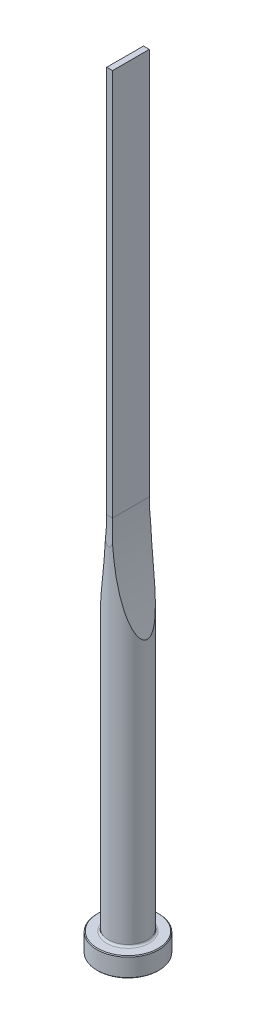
ISO-10303-21;
HEADER;
FILE_DESCRIPTION(('STEP AP214'),'2;1');
FILE_NAME('part.step','',(''),(''),'','','');
FILE_SCHEMA(('AUTOMOTIVE_DESIGN { 1 0 10303 214 1 1 1 1 }'));
ENDSEC;
DATA;
#1=APPLICATION_CONTEXT('core data for automotive mechanical design processes');
#2=APPLICATION_PROTOCOL_DEFINITION('international standard','automotive_design',2000,#1);
#3=PRODUCT_CONTEXT('',#1,'mechanical');
#4=PRODUCT('Part','Part','',(#3));
#5=PRODUCT_RELATED_PRODUCT_CATEGORY('part','',(#4));
#6=PRODUCT_DEFINITION_FORMATION('','',#4);
#7=PRODUCT_DEFINITION_CONTEXT('part definition',#1,'design');
#8=PRODUCT_DEFINITION('design','',#6,#7);
#9=PRODUCT_DEFINITION_SHAPE('','',#8);
#10=(LENGTH_UNIT() NAMED_UNIT(*) SI_UNIT(.MILLI.,.METRE.));
#11=(NAMED_UNIT(*) PLANE_ANGLE_UNIT() SI_UNIT($,.RADIAN.));
#12=(NAMED_UNIT(*) SI_UNIT($,.STERADIAN.) SOLID_ANGLE_UNIT());
#13=UNCERTAINTY_MEASURE_WITH_UNIT(LENGTH_MEASURE(1.E-05),#10,'distance_accuracy_value','');
#14=(GEOMETRIC_REPRESENTATION_CONTEXT(3) GLOBAL_UNCERTAINTY_ASSIGNED_CONTEXT((#13)) GLOBAL_UNIT_ASSIGNED_CONTEXT((#10,
#11,#12)) REPRESENTATION_CONTEXT('',''));
#15=CARTESIAN_POINT('',(0.,0.,0.));
#16=DIRECTION('',(0.,0.,1.));
#17=DIRECTION('',(1.,0.,0.));
#18=AXIS2_PLACEMENT_3D('',#15,#16,#17);
#19=CARTESIAN_POINT('',(0.,0.,0.));
#20=DIRECTION('',(0.,1.,0.));
#21=DIRECTION('',(-1.,0.,0.));
#22=AXIS2_PLACEMENT_3D('',#19,#20,#21);
#23=PLANE('',#22);
#24=CARTESIAN_POINT('',(0.,0.,0.));
#25=DIRECTION('',(0.,1.,0.));
#26=DIRECTION('',(-1.,0.,0.));
#27=AXIS2_PLACEMENT_3D('',#24,#25,#26);
#28=CIRCLE('',#27,7.8);
#29=CARTESIAN_POINT('',(-7.8,0.,0.));
#30=VERTEX_POINT('',#29);
#31=EDGE_CURVE('E133',#30,#30,#28,.T.);
#32=ORIENTED_EDGE('',*,*,#31,.F.);
#33=EDGE_LOOP('',(#32));
#34=FACE_BOUND('',#33,.T.);
#35=ADVANCED_FACE('F32',(#34),#23,.F.);
#36=CARTESIAN_POINT('',(0.,0.,0.));
#37=DIRECTION('',(0.,1.,0.));
#38=DIRECTION('',(-1.,0.,0.));
#39=AXIS2_PLACEMENT_3D('',#36,#37,#38);
#40=CONICAL_SURFACE('',#39,7.8,0.785398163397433);
#41=CARTESIAN_POINT('',(0.,0.200000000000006,0.));
#42=DIRECTION('',(0.,1.,0.));
#43=DIRECTION('',(-1.,0.,0.));
#44=AXIS2_PLACEMENT_3D('',#41,#42,#43);
#45=CIRCLE('',#44,8.);
#46=CARTESIAN_POINT('',(-8.,0.200000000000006,0.));
#47=VERTEX_POINT('',#46);
#48=EDGE_CURVE('E130',#47,#47,#45,.T.);
#49=ORIENTED_EDGE('',*,*,#48,.F.);
#50=EDGE_LOOP('',(#49));
#51=FACE_BOUND('',#50,.T.);
#52=ORIENTED_EDGE('',*,*,#31,.T.);
#53=EDGE_LOOP('',(#52));
#54=FACE_BOUND('',#53,.T.);
#55=ADVANCED_FACE('F171',(#51,#54),#40,.T.);
#56=CARTESIAN_POINT('',(0.,200.,0.));
#57=DIRECTION('',(0.,1.,0.));
#58=DIRECTION('',(-1.,0.,0.));
#59=AXIS2_PLACEMENT_3D('',#56,#57,#58);
#60=CYLINDRICAL_SURFACE('',#59,8.);
#61=CARTESIAN_POINT('',(0.,4.8,0.));
#62=DIRECTION('',(0.,1.,0.));
#63=DIRECTION('',(-1.,0.,0.));
#64=AXIS2_PLACEMENT_3D('',#61,#62,#63);
#65=CIRCLE('',#64,8.);
#66=CARTESIAN_POINT('',(-8.,4.8,0.));
#67=VERTEX_POINT('',#66);
#68=EDGE_CURVE('E127',#67,#67,#65,.T.);
#69=ORIENTED_EDGE('',*,*,#68,.F.);
#70=EDGE_LOOP('',(#69));
#71=FACE_BOUND('',#70,.T.);
#72=ORIENTED_EDGE('',*,*,#48,.T.);
#73=EDGE_LOOP('',(#72));
#74=FACE_BOUND('',#73,.T.);
#75=ADVANCED_FACE('F176',(#71,#74),#60,.T.);
#76=CARTESIAN_POINT('',(0.,4.8,0.));
#77=DIRECTION('',(0.,-1.,0.));
#78=DIRECTION('',(1.,0.,0.));
#79=AXIS2_PLACEMENT_3D('',#76,#77,#78);
#80=CONICAL_SURFACE('',#79,8.,0.785398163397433);
#81=CARTESIAN_POINT('',(0.,5.,0.));
#82=DIRECTION('',(0.,1.,0.));
#83=DIRECTION('',(-1.,0.,0.));
#84=AXIS2_PLACEMENT_3D('',#81,#82,#83);
#85=CIRCLE('',#84,7.8);
#86=CARTESIAN_POINT('',(-7.8,5.,0.));
#87=VERTEX_POINT('',#86);
#88=EDGE_CURVE('E124',#87,#87,#85,.T.);
#89=ORIENTED_EDGE('',*,*,#88,.F.);
#90=EDGE_LOOP('',(#89));
#91=FACE_BOUND('',#90,.T.);
#92=ORIENTED_EDGE('',*,*,#68,.T.);
#93=EDGE_LOOP('',(#92));
#94=FACE_BOUND('',#93,.T.);
#95=ADVANCED_FACE('F183',(#91,#94),#80,.T.);
#96=CARTESIAN_POINT('',(7.8,5.,0.));
#97=DIRECTION('',(0.,-1.,0.));
#98=DIRECTION('',(1.,0.,0.));
#99=AXIS2_PLACEMENT_3D('',#96,#97,#98);
#100=PLANE('',#99);
#101=CARTESIAN_POINT('',(0.,5.,0.));
#102=DIRECTION('',(0.,1.,0.));
#103=DIRECTION('',(-1.,0.,0.));
#104=AXIS2_PLACEMENT_3D('',#101,#102,#103);
#105=CIRCLE('',#104,5.50000000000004);
#106=CARTESIAN_POINT('',(-5.50000000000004,5.,0.));
#107=VERTEX_POINT('',#106);
#108=EDGE_CURVE('E121',#107,#107,#105,.T.);
#109=ORIENTED_EDGE('',*,*,#108,.F.);
#110=EDGE_LOOP('',(#109));
#111=FACE_BOUND('',#110,.T.);
#112=ORIENTED_EDGE('',*,*,#88,.T.);
#113=EDGE_LOOP('',(#112));
#114=FACE_BOUND('',#113,.T.);
#115=ADVANCED_FACE('F190',(#111,#114),#100,.F.);
#116=CARTESIAN_POINT('',(0.,5.5,0.));
#117=DIRECTION('',(0.,1.,0.));
#118=DIRECTION('',(-1.,0.,0.));
#119=AXIS2_PLACEMENT_3D('',#116,#117,#118);
#120=TOROIDAL_SURFACE('',#119,5.50000000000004,0.5);
#121=CARTESIAN_POINT('',(0.,5.50000000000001,0.));
#122=DIRECTION('',(0.,1.,0.));
#123=DIRECTION('',(-1.,0.,0.));
#124=AXIS2_PLACEMENT_3D('',#121,#122,#123);
#125=CIRCLE('',#124,5.00000000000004);
#126=CARTESIAN_POINT('',(-5.00000000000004,5.50000000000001,0.));
#127=VERTEX_POINT('',#126);
#128=EDGE_CURVE('E112',#127,#127,#125,.T.);
#129=ORIENTED_EDGE('',*,*,#128,.F.);
#130=EDGE_LOOP('',(#129));
#131=FACE_BOUND('',#130,.T.);
#132=ORIENTED_EDGE('',*,*,#108,.T.);
#133=EDGE_LOOP('',(#132));
#134=FACE_BOUND('',#133,.T.);
#135=ADVANCED_FACE('F168',(#131,#134),#120,.F.);
#136=CARTESIAN_POINT('',(0.,200.,0.));
#137=DIRECTION('',(0.,1.,0.));
#138=DIRECTION('',(-1.,0.,0.));
#139=AXIS2_PLACEMENT_3D('',#136,#137,#138);
#140=CYLINDRICAL_SURFACE('',#139,5.00000000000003);
#141=CARTESIAN_POINT('',(5.00000000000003,72.6698426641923,0.));
#142=CARTESIAN_POINT('',(4.99999699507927,72.6698517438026,0.0982088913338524));
#143=CARTESIAN_POINT('',(4.99706880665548,72.6790343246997,0.19644965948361));
#144=CARTESIAN_POINT('',(4.98575197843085,72.7145811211,0.389459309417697));
#145=CARTESIAN_POINT('',(4.97735516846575,72.7409710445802,0.484222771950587));
#146=CARTESIAN_POINT('',(4.95365028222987,72.8156623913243,0.688624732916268));
#147=CARTESIAN_POINT('',(4.9372096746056,72.867566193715,0.796789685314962));
#148=CARTESIAN_POINT('',(4.89948999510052,72.987154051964,1.00302693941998));
#149=CARTESIAN_POINT('',(4.87820124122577,73.0548696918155,1.10107846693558));
#150=CARTESIAN_POINT('',(4.8359382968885,73.1899604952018,1.27288902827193));
#151=CARTESIAN_POINT('',(4.81543376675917,73.2557387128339,1.34805086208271));
#152=CARTESIAN_POINT('',(4.77273910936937,73.3933128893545,1.49218520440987));
#153=CARTESIAN_POINT('',(4.75054772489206,73.4651133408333,1.56115301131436));
#154=CARTESIAN_POINT('',(4.70492872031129,73.6134173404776,1.69368419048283));
#155=CARTESIAN_POINT('',(4.68149855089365,73.689930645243,1.75723565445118));
#156=CARTESIAN_POINT('',(4.63379920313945,73.8464790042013,1.8794149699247));
#157=CARTESIAN_POINT('',(4.60953025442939,73.9265130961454,1.93804415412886));
#158=CARTESIAN_POINT('',(4.55107793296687,74.1202862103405,2.07241841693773));
#159=CARTESIAN_POINT('',(4.51662674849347,74.2352913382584,2.14621682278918));
#160=CARTESIAN_POINT('',(4.44705609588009,74.4692969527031,2.2868847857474));
#161=CARTESIAN_POINT('',(4.41193633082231,74.5882992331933,2.35375117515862));
#162=CARTESIAN_POINT('',(4.34130054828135,74.8295316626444,2.48162307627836));
#163=CARTESIAN_POINT('',(4.30578400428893,74.9517664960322,2.54261941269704));
#164=CARTESIAN_POINT('',(4.23462595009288,75.1986576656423,2.65943766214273));
#165=CARTESIAN_POINT('',(4.19898441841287,75.3233144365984,2.71525863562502));
#166=CARTESIAN_POINT('',(4.09180404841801,75.7013215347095,2.87644213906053));
#167=CARTESIAN_POINT('',(4.02032821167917,75.9576217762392,2.97496635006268));
#168=CARTESIAN_POINT('',(3.91395519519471,76.3458381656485,3.11195272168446));
#169=CARTESIAN_POINT('',(3.87865329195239,76.4758121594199,3.15579760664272));
#170=CARTESIAN_POINT('',(3.80837436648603,76.736896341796,3.24026413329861));
#171=CARTESIAN_POINT('',(3.7733973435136,76.8680065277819,3.28088578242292));
#172=CARTESIAN_POINT('',(3.67901594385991,77.2250552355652,3.38716791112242));
#173=CARTESIAN_POINT('',(3.6199832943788,77.4519279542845,3.45002099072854));
#174=CARTESIAN_POINT('',(3.50325291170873,77.9079079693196,3.56849067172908));
#175=CARTESIAN_POINT('',(3.44555534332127,78.1370155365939,3.62410638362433));
#176=CARTESIAN_POINT('',(3.3316215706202,78.5971192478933,3.72911556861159));
#177=CARTESIAN_POINT('',(3.27538602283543,78.8281161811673,3.77850628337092));
#178=CARTESIAN_POINT('',(3.16450650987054,79.2915928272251,3.87183907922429));
#179=CARTESIAN_POINT('',(3.10986263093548,79.5240726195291,3.91578086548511));
#180=CARTESIAN_POINT('',(2.94823548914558,80.2242611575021,4.04061145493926));
#181=CARTESIAN_POINT('',(2.84377434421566,80.6938409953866,4.11431091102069));
#182=CARTESIAN_POINT('',(2.64200093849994,81.6366395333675,4.24668601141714));
#183=CARTESIAN_POINT('',(2.54468945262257,82.1098586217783,4.30536002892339));
#184=CARTESIAN_POINT('',(2.40413804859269,82.822469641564,4.3844045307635));
#185=CARTESIAN_POINT('',(2.35812547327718,83.0608289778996,4.40928874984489));
#186=CARTESIAN_POINT('',(2.26798702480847,83.5381542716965,4.45632364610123));
#187=CARTESIAN_POINT('',(2.22386100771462,83.7771201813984,4.4784745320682));
#188=CARTESIAN_POINT('',(2.09433007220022,84.4948846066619,4.54125653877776));
#189=CARTESIAN_POINT('',(2.01177741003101,84.9745237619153,4.57821418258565));
#190=CARTESIAN_POINT('',(1.85448213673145,85.9350267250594,4.64415195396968));
#191=CARTESIAN_POINT('',(1.77973040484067,86.4158884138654,4.6731414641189));
#192=CARTESIAN_POINT('',(1.63799243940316,87.3791013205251,4.72468650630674));
#193=CARTESIAN_POINT('',(1.57100633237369,87.8614525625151,4.74724193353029));
#194=CARTESIAN_POINT('',(1.42973388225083,88.9431195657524,4.7919306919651));
#195=CARTESIAN_POINT('',(1.35754438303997,89.5427671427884,4.8126678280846));
#196=CARTESIAN_POINT('',(1.22523387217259,90.7435887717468,4.84803900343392));
#197=CARTESIAN_POINT('',(1.16511336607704,91.3447628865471,4.86267278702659));
#198=CARTESIAN_POINT('',(1.05697486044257,92.5483953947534,4.88731818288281));
#199=CARTESIAN_POINT('',(1.00895895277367,93.150853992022,4.89732899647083));
#200=CARTESIAN_POINT('',(0.925070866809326,94.3566541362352,4.91386505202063));
#201=CARTESIAN_POINT('',(0.88919853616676,94.9599956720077,4.92039033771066));
#202=CARTESIAN_POINT('',(0.829566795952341,96.1682704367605,4.930794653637));
#203=CARTESIAN_POINT('',(0.805826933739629,96.7732046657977,4.93466941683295));
#204=CARTESIAN_POINT('',(0.770558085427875,97.9834402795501,4.94029945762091));
#205=CARTESIAN_POINT('',(0.759029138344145,98.5887416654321,4.94205472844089));
#206=CARTESIAN_POINT('',(0.748188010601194,99.7993893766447,4.94370758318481));
#207=CARTESIAN_POINT('',(0.748874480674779,100.404735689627,4.9436053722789));
#208=CARTESIAN_POINT('',(0.762460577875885,101.615287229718,4.94152823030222));
#209=CARTESIAN_POINT('',(0.775360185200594,102.220492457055,4.93955330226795));
#210=CARTESIAN_POINT('',(0.813323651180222,103.429137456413,4.93344440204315));
#211=CARTESIAN_POINT('',(0.838359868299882,104.032578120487,4.92931533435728));
#212=CARTESIAN_POINT('',(0.900572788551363,105.238811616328,4.9183297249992));
#213=CARTESIAN_POINT('',(0.937749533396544,105.841604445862,4.91147317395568));
#214=CARTESIAN_POINT('',(1.0242346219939,107.046408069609,4.89416898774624));
#215=CARTESIAN_POINT('',(1.07354573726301,107.648418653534,4.8837205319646));
#216=CARTESIAN_POINT('',(1.18426659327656,108.851222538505,4.85805977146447));
#217=CARTESIAN_POINT('',(1.24567622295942,109.452015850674,4.84284751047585));
#218=CARTESIAN_POINT('',(1.38041540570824,110.650842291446,4.80617538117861));
#219=CARTESIAN_POINT('',(1.45372050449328,111.248878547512,4.7847282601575));
#220=CARTESIAN_POINT('',(1.61227917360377,112.443051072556,4.73365637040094));
#221=CARTESIAN_POINT('',(1.69753323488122,113.039187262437,4.70403126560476));
#222=CARTESIAN_POINT('',(1.87984552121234,114.228758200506,4.63418918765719));
#223=CARTESIAN_POINT('',(1.97689829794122,114.822194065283,4.59397709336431));
#224=CARTESIAN_POINT('',(2.18267352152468,116.005918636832,4.49986490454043));
#225=CARTESIAN_POINT('',(2.29139448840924,116.596207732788,4.44596654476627));
#226=CARTESIAN_POINT('',(2.459863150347,117.462299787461,4.35348615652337));
#227=CARTESIAN_POINT('',(2.51518571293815,117.739713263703,4.32182626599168));
#228=CARTESIAN_POINT('',(2.62833111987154,118.293477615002,4.25396725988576));
#229=CARTESIAN_POINT('',(2.68615395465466,118.569828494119,4.21776816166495));
#230=CARTESIAN_POINT('',(2.80427875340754,119.121446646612,4.14017109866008));
#231=CARTESIAN_POINT('',(2.86458217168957,119.396713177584,4.09877005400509));
#232=CARTESIAN_POINT('',(2.98755952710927,119.945755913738,4.01001761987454));
#233=CARTESIAN_POINT('',(3.05023343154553,120.21953213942,3.96266631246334));
#234=CARTESIAN_POINT('',(3.17767517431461,120.764537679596,3.86121727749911));
#235=CARTESIAN_POINT('',(3.24243683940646,121.035771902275,3.80713829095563));
#236=CARTESIAN_POINT('',(3.37406891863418,121.576003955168,3.69098491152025));
#237=CARTESIAN_POINT('',(3.44093920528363,121.845001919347,3.62891100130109));
#238=CARTESIAN_POINT('',(3.57652106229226,122.379915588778,3.49536098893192));
#239=CARTESIAN_POINT('',(3.64523082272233,122.645833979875,3.42389387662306));
#240=CARTESIAN_POINT('',(3.78423448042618,123.173910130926,3.26961382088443));
#241=CARTESIAN_POINT('',(3.8545279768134,123.436068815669,3.18680372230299));
#242=CARTESIAN_POINT('',(3.98084744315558,123.898924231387,3.0266910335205));
#243=CARTESIAN_POINT('',(4.03665872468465,124.1006111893,2.95209405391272));
#244=CARTESIAN_POINT('',(4.14863367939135,124.499925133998,2.79255461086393));
#245=CARTESIAN_POINT('',(4.20479751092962,124.697550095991,2.70760712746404));
#246=CARTESIAN_POINT('',(4.31689598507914,125.087040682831,2.5250537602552));
#247=CARTESIAN_POINT('',(4.37283057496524,125.278905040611,2.42744511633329));
#248=CARTESIAN_POINT('',(4.48350393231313,125.654038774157,2.21640446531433));
#249=CARTESIAN_POINT('',(4.53824401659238,125.837317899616,2.10299101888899));
#250=CARTESIAN_POINT('',(4.61847515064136,126.103049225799,1.91683821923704));
#251=CARTESIAN_POINT('',(4.64503859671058,126.1905248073,1.85173475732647));
#252=CARTESIAN_POINT('',(4.69706434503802,126.360959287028,1.71549282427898));
#253=CARTESIAN_POINT('',(4.72252723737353,126.443920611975,1.64435764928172));
#254=CARTESIAN_POINT('',(4.77174387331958,126.603503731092,1.4955175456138));
#255=CARTESIAN_POINT('',(4.79550570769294,126.680155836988,1.41784815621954));
#256=CARTESIAN_POINT('',(4.84072891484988,126.825415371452,1.25478768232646));
#257=CARTESIAN_POINT('',(4.86219348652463,126.894033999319,1.16940764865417));
#258=CARTESIAN_POINT('',(4.89983178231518,127.013925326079,0.999221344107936));
#259=CARTESIAN_POINT('',(4.91632155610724,127.066252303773,0.915239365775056));
#260=CARTESIAN_POINT('',(4.94568332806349,127.159190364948,0.74031482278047));
#261=CARTESIAN_POINT('',(4.95855605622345,127.199803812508,0.649373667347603));
#262=CARTESIAN_POINT('',(4.97967235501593,127.266318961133,0.460408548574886));
#263=CARTESIAN_POINT('',(4.98786140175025,127.292047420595,0.362315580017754));
#264=CARTESIAN_POINT('',(4.99834260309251,127.324962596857,0.162784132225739));
#265=CARTESIAN_POINT('',(5.00064333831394,127.332176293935,0.0613507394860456));
#266=CARTESIAN_POINT('',(4.99912871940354,127.327423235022,-0.12973866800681));
#267=CARTESIAN_POINT('',(4.99596097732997,127.317487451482,-0.219457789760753));
#268=CARTESIAN_POINT('',(4.98509069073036,127.283340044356,-0.395853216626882));
#269=CARTESIAN_POINT('',(4.97738412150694,127.259115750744,-0.482526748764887));
#270=CARTESIAN_POINT('',(4.95515693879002,127.189090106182,-0.677358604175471));
#271=CARTESIAN_POINT('',(4.93925948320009,127.138911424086,-0.783765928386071));
#272=CARTESIAN_POINT('',(4.90272769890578,127.023129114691,-0.986908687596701));
#273=CARTESIAN_POINT('',(4.88208302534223,126.957491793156,-1.08362232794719));
#274=CARTESIAN_POINT('',(4.84100760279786,126.826274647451,-1.25341133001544));
#275=CARTESIAN_POINT('',(4.82103631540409,126.762251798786,-1.32783051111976));
#276=CARTESIAN_POINT('',(4.7794126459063,126.628237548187,-1.47062973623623));
#277=CARTESIAN_POINT('',(4.75775900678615,126.558241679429,-1.53900518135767));
#278=CARTESIAN_POINT('',(4.71321084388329,126.413569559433,-1.67046986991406));
#279=CARTESIAN_POINT('',(4.69031369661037,126.33888335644,-1.73354716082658));
#280=CARTESIAN_POINT('',(4.64367110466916,126.18599846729,-1.85486860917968));
#281=CARTESIAN_POINT('',(4.61992588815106,126.107800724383,-1.91311405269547));
#282=CARTESIAN_POINT('',(4.563032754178,125.919482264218,-2.04589785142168));
#283=CARTESIAN_POINT('',(4.52962317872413,125.80814935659,-2.11860066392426));
#284=CARTESIAN_POINT('',(4.46212127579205,125.58155553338,-2.25730286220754));
#285=CARTESIAN_POINT('',(4.42802864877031,125.466292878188,-2.32329922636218));
#286=CARTESIAN_POINT('',(4.35942592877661,125.232589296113,-2.44960786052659));
#287=CARTESIAN_POINT('',(4.32491528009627,125.114143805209,-2.50991133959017));
#288=CARTESIAN_POINT('',(4.25574061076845,124.874859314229,-2.62548976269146));
#289=CARTESIAN_POINT('',(4.22107656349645,124.754019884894,-2.68076379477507));
#290=CARTESIAN_POINT('',(4.11679730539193,124.387553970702,-2.84047005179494));
#291=CARTESIAN_POINT('',(4.04719699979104,124.139007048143,-2.93824759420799));
#292=CARTESIAN_POINT('',(3.94352939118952,123.762442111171,-3.07437538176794));
#293=CARTESIAN_POINT('',(3.90911066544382,123.636352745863,-3.11797799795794));
#294=CARTESIAN_POINT('',(3.84056213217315,123.383045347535,-3.20203557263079));
#295=CARTESIAN_POINT('',(3.80643232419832,123.255827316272,-3.24249053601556));
#296=CARTESIAN_POINT('',(3.71467888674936,122.910771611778,-3.3479732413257));
#297=CARTESIAN_POINT('',(3.65738498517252,122.692023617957,-3.41031063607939));
#298=CARTESIAN_POINT('',(3.54400618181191,122.252330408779,-3.52798636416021));
#299=CARTESIAN_POINT('',(3.48792142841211,122.031384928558,-3.5833238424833));
#300=CARTESIAN_POINT('',(3.37708493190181,121.587636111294,-3.68796817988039));
#301=CARTESIAN_POINT('',(3.32233378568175,121.36483200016,-3.73727237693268));
#302=CARTESIAN_POINT('',(3.21429209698,120.917761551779,-3.83058875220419));
#303=CARTESIAN_POINT('',(3.16100163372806,120.693495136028,-3.87460064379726));
#304=CARTESIAN_POINT('',(3.00324290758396,120.01800811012,-3.99983204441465));
#305=CARTESIAN_POINT('',(2.90109756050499,119.564940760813,-4.07405450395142));
#306=CARTESIAN_POINT('',(2.70342192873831,118.655210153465,-4.20781492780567));
#307=CARTESIAN_POINT('',(2.60789236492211,118.198546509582,-4.26735129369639));
#308=CARTESIAN_POINT('',(2.46960125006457,117.510743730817,-4.34786272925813));
#309=CARTESIAN_POINT('',(2.42426738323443,117.28062593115,-4.37326900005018));
#310=CARTESIAN_POINT('',(2.33535330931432,116.819789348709,-4.42138908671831));
#311=CARTESIAN_POINT('',(2.29177296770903,116.589070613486,-4.44410310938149));
#312=CARTESIAN_POINT('',(2.16367988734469,115.896056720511,-4.50861966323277));
#313=CARTESIAN_POINT('',(2.08182015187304,115.432929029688,-4.54679379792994));
#314=CARTESIAN_POINT('',(1.92537933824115,114.505437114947,-4.61521211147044));
#315=CARTESIAN_POINT('',(1.85078986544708,114.041074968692,-4.64546550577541));
#316=CARTESIAN_POINT('',(1.70884969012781,113.110870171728,-4.69953135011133));
#317=CARTESIAN_POINT('',(1.64149909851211,112.645027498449,-4.72334370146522));
#318=CARTESIAN_POINT('',(1.49589073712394,111.578873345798,-4.77176871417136));
#319=CARTESIAN_POINT('',(1.42001220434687,110.978158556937,-4.79466730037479));
#320=CARTESIAN_POINT('',(1.28037168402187,109.775088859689,-4.83382826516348));
#321=CARTESIAN_POINT('',(1.21661025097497,109.172733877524,-4.85009034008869));
#322=CARTESIAN_POINT('',(1.10124220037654,107.966636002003,-4.87757947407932));
#323=CARTESIAN_POINT('',(1.04963784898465,107.362892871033,-4.88880559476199));
#324=CARTESIAN_POINT('',(0.958630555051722,106.154440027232,-4.9074619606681));
#325=CARTESIAN_POINT('',(0.919227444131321,105.549730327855,-4.91489225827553));
#326=CARTESIAN_POINT('',(0.852590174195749,104.33866988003,-4.92688920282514));
#327=CARTESIAN_POINT('',(0.825375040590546,103.732318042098,-4.93145137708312));
#328=CARTESIAN_POINT('',(0.783216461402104,102.51917366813,-4.93832234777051));
#329=CARTESIAN_POINT('',(0.768273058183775,101.91238113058,-4.94063113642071));
#330=CARTESIAN_POINT('',(0.750665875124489,100.69868327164,-4.94333691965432));
#331=CARTESIAN_POINT('',(0.74800069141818,100.091777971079,-4.94373413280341));
#332=CARTESIAN_POINT('',(0.754947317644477,98.8780402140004,-4.94267812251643));
#333=CARTESIAN_POINT('',(0.764559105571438,98.2712077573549,-4.94122490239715));
#334=CARTESIAN_POINT('',(0.795991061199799,97.0603449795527,-4.93625874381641));
#335=CARTESIAN_POINT('',(0.817761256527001,96.456313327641,-4.93275423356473));
#336=CARTESIAN_POINT('',(0.873464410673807,95.2488284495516,-4.923196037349));
#337=CARTESIAN_POINT('',(0.907397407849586,94.6453752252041,-4.9171423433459));
#338=CARTESIAN_POINT('',(0.98741792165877,93.4391877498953,-4.9017005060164));
#339=CARTESIAN_POINT('',(1.03350801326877,92.8364536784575,-4.8923116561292));
#340=CARTESIAN_POINT('',(1.13781360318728,91.6321230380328,-4.86911049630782));
#341=CARTESIAN_POINT('',(1.19602899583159,91.0305264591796,-4.85529822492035));
#342=CARTESIAN_POINT('',(1.32443333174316,89.8298524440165,-4.82185371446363));
#343=CARTESIAN_POINT('',(1.39460080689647,89.2307724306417,-4.80223186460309));
#344=CARTESIAN_POINT('',(1.54692746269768,88.0344046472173,-4.75535211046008));
#345=CARTESIAN_POINT('',(1.629087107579,87.4371169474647,-4.72809391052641));
#346=CARTESIAN_POINT('',(1.80526862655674,86.2450880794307,-4.66366847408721));
#347=CARTESIAN_POINT('',(1.89928532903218,85.6503459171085,-4.62650554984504));
#348=CARTESIAN_POINT('',(2.09906338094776,84.4638081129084,-4.5393663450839));
#349=CARTESIAN_POINT('',(2.20482329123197,83.8720121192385,-4.48939163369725));
#350=CARTESIAN_POINT('',(2.3453222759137,83.1288018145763,-4.41593936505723));
#351=CARTESIAN_POINT('',(2.37470006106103,82.9755856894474,-4.40022149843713));
#352=CARTESIAN_POINT('',(2.43422691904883,82.6694333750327,-4.36757305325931));
#353=CARTESIAN_POINT('',(2.46437598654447,82.5164971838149,-4.35064248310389));
#354=CARTESIAN_POINT('',(2.55597254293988,82.0581321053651,-4.29790342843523));
#355=CARTESIAN_POINT('',(2.61856824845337,81.753152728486,-4.26014818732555));
#356=CARTESIAN_POINT('',(2.74669084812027,81.1449194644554,-4.1786902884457));
#357=CARTESIAN_POINT('',(2.81221479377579,80.8416641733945,-4.13499352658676));
#358=CARTESIAN_POINT('',(2.946153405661,80.2368911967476,-4.04065297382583));
#359=CARTESIAN_POINT('',(3.01456796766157,79.9353734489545,-3.99000943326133));
#360=CARTESIAN_POINT('',(3.18170490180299,79.2159060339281,-3.85903385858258));
#361=CARTESIAN_POINT('',(3.28173935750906,78.7989337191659,-3.77487006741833));
#362=CARTESIAN_POINT('',(3.4354858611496,78.1775045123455,-3.63349010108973));
#363=CARTESIAN_POINT('',(3.48739125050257,77.9708778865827,-3.58379764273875));
#364=CARTESIAN_POINT('',(3.59230596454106,77.5593798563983,-3.47863022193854));
#365=CARTESIAN_POINT('',(3.6453152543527,77.3545083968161,-3.42315544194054));
#366=CARTESIAN_POINT('',(3.75469886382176,76.9377788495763,-3.30289868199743));
#367=CARTESIAN_POINT('',(3.81111740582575,76.7260200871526,-3.23781064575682));
#368=CARTESIAN_POINT('',(3.92476947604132,76.3055544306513,-3.09906983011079));
#369=CARTESIAN_POINT('',(3.98200290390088,76.0968471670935,-3.02541809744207));
#370=CARTESIAN_POINT('',(4.09681892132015,75.6839143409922,-2.86802214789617));
#371=CARTESIAN_POINT('',(4.15440042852,75.4796797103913,-2.78430113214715));
#372=CARTESIAN_POINT('',(4.269491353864,75.0768094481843,-2.60439511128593));
#373=CARTESIAN_POINT('',(4.3270007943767,74.8781707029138,-2.50821721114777));
#374=CARTESIAN_POINT('',(4.43028324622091,74.5258260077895,-2.31987628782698));
#375=CARTESIAN_POINT('',(4.47621505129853,74.3707387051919,-2.23040647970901));
#376=CARTESIAN_POINT('',(4.56679022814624,74.0677933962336,-2.03855775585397));
#377=CARTESIAN_POINT('',(4.61143110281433,73.9199490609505,-1.93615564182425));
#378=CARTESIAN_POINT('',(4.69845402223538,73.6342280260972,-1.71432946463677));
#379=CARTESIAN_POINT('',(4.74080961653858,73.4964633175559,-1.59474829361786));
#380=CARTESIAN_POINT('',(4.82032680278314,73.2397854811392,-1.33521257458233));
#381=CARTESIAN_POINT('',(4.85750638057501,73.1208068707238,-1.19533221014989));
#382=CARTESIAN_POINT('',(4.90769951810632,72.9610821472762,-0.960061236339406));
#383=CARTESIAN_POINT('',(4.92405693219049,72.9092307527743,-0.872993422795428));
#384=CARTESIAN_POINT('',(4.95276787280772,72.818439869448,-0.691721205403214));
#385=CARTESIAN_POINT('',(4.9651275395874,72.7794805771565,-0.597528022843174));
#386=CARTESIAN_POINT('',(4.98299962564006,72.7232263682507,-0.419843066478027));
#387=CARTESIAN_POINT('',(4.98931861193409,72.7033752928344,-0.337252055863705));
#388=CARTESIAN_POINT('',(4.99781898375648,72.676683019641,-0.169781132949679));
#389=CARTESIAN_POINT('',(5.00000259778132,72.6698348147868,-0.0849024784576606));
#390=CARTESIAN_POINT('',(5.00000000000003,72.6698426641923,0.));
#391=B_SPLINE_CURVE_WITH_KNOTS('',3,(#141,#142,#143,#144,#145,#146,#147,#148,#149,#150,#151,
#152,#153,#154,#155,#156,#157,#158,#159,#160,#161,#162,#163,#164,#165,#166,#167,#168,#169,#170,
#171,#172,#173,#174,#175,#176,#177,#178,#179,#180,#181,#182,#183,#184,#185,#186,#187,#188,#189,
#190,#191,#192,#193,#194,#195,#196,#197,#198,#199,#200,#201,#202,#203,#204,#205,#206,#207,#208,
#209,#210,#211,#212,#213,#214,#215,#216,#217,#218,#219,#220,#221,#222,#223,#224,#225,#226,#227,
#228,#229,#230,#231,#232,#233,#234,#235,#236,#237,#238,#239,#240,#241,#242,#243,#244,#245,#246,
#247,#248,#249,#250,#251,#252,#253,#254,#255,#256,#257,#258,#259,#260,#261,#262,#263,#264,#265,
#266,#267,#268,#269,#270,#271,#272,#273,#274,#275,#276,#277,#278,#279,#280,#281,#282,#283,#284,
#285,#286,#287,#288,#289,#290,#291,#292,#293,#294,#295,#296,#297,#298,#299,#300,#301,#302,#303,
#304,#305,#306,#307,#308,#309,#310,#311,#312,#313,#314,#315,#316,#317,#318,#319,#320,#321,#322,
#323,#324,#325,#326,#327,#328,#329,#330,#331,#332,#333,#334,#335,#336,#337,#338,#339,#340,#341,
#342,#343,#344,#345,#346,#347,#348,#349,#350,#351,#352,#353,#354,#355,#356,#357,#358,#359,#360,
#361,#362,#363,#364,#365,#366,#367,#368,#369,#370,#371,#372,#373,#374,#375,#376,#377,#378,#379,
#380,#381,#382,#383,#384,#385,#386,#387,#388,#389,#390),.UNSPECIFIED.,.T.,.F.,(4,2,2,2,2,2,2,2,
2,2,2,2,2,2,2,2,2,2,2,2,2,2,2,2,2,2,2,2,2,2,2,2,2,2,2,2,2,2,2,2,2,2,2,2,2,2,2,2,2,2,2,2,2,2,2,2,
2,2,2,2,2,2,2,2,2,2,2,2,2,2,2,2,2,2,2,2,2,2,2,2,2,2,2,2,2,2,2,2,2,2,2,2,2,2,2,2,2,2,2,2,2,2,2,2,
2,2,2,2,2,2,2,2,2,2,2,2,2,2,2,2,2,2,2,2,4),(0.,0.294245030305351,0.588930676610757,
0.950164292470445,1.31212573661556,1.61758407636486,1.92327235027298,2.2296162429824,
2.53587692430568,2.95834524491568,3.38100577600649,3.8043165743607,4.22770407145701,
5.07825920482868,5.50315578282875,5.92805138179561,6.65601763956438,7.38407328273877,
8.11245040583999,8.84086692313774,10.300473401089,11.7602378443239,12.4923132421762,
13.2243326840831,14.6884516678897,16.1508391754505,17.6132505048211,19.4260810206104,
21.2389874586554,23.0522069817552,24.8654037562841,26.6815127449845,28.4976275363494,
30.3135417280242,32.1294529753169,33.94124771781,35.7530486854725,37.5652638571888,
39.3774623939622,41.1859816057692,42.9945751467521,44.802336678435,46.6098691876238,
47.4637565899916,48.3176407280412,49.1720328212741,50.0264131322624,50.878464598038,
51.7304646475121,52.5816551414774,53.4326325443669,54.0989116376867,54.7655151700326,
55.4322642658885,56.0982368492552,56.4347350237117,56.7710504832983,57.1056422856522,
57.4397619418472,57.7399102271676,58.0399978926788,58.3435113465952,58.646582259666,
58.9161704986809,59.1859981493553,59.5401534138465,59.8950878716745,60.1952011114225,
60.4955407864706,60.7965407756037,61.0974603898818,61.5084756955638,61.919675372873,
62.3314999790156,62.7433991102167,63.5707846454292,63.9841133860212,64.397441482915,
65.1009780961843,65.8046005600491,66.5085323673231,67.2125022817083,68.6231039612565,
70.0338591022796,70.7415778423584,71.4492421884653,72.8646483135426,74.2784002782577,
75.6921739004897,77.5097580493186,79.3274253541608,81.1454312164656,82.9634119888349,
84.7842208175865,86.6050359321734,88.4256428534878,90.2462465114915,92.0594217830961,
93.8726027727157,95.686168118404,97.4997176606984,99.3100434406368,101.120439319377,
102.930048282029,104.739435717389,105.209821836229,105.680204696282,106.620988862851,
107.560846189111,108.500669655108,109.811133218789,110.467360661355,111.123567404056,
111.809237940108,112.494824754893,113.178861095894,113.862508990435,114.416600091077,
114.971699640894,115.532243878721,116.090788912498,116.397869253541,116.704475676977,
116.958990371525,117.213367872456),.UNSPECIFIED.);
#392=CARTESIAN_POINT('',(0.915475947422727,94.5448842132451,-4.91547594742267));
#393=VERTEX_POINT('',#392);
#394=CARTESIAN_POINT('',(0.915475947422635,94.5448842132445,4.91547594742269));
#395=VERTEX_POINT('',#394);
#396=EDGE_CURVE('E138',#393,#395,#391,.T.);
#397=ORIENTED_EDGE('',*,*,#396,.T.);
#398=CARTESIAN_POINT('',(-1.56124949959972,100.,4.74999999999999));
#399=CARTESIAN_POINT('',(-1.56124909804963,100.280275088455,4.74999999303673));
#400=CARTESIAN_POINT('',(-1.55728190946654,100.560549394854,4.7513095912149));
#401=CARTESIAN_POINT('',(-1.54122236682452,101.120839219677,4.75654354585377));
#402=CARTESIAN_POINT('',(-1.52913016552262,101.400854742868,4.76046785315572));
#403=CARTESIAN_POINT('',(-1.49622334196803,101.960158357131,4.77091379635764));
#404=CARTESIAN_POINT('',(-1.47541419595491,102.23944679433,4.77743380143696));
#405=CARTESIAN_POINT('',(-1.42390023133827,102.796993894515,4.79304036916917));
#406=CARTESIAN_POINT('',(-1.39319740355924,103.075252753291,4.80212641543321));
#407=CARTESIAN_POINT('',(-1.32163854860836,103.616514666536,4.8223042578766));
#408=CARTESIAN_POINT('',(-1.28135596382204,103.879595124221,4.83327546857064));
#409=CARTESIAN_POINT('',(-1.21025315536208,104.272594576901,4.85137807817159));
#410=CARTESIAN_POINT('',(-1.18472794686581,104.403511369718,4.85769686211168));
#411=CARTESIAN_POINT('',(-1.12941406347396,104.664393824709,4.87085630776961));
#412=CARTESIAN_POINT('',(-1.09962649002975,104.794359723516,4.87769683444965));
#413=CARTESIAN_POINT('',(-1.04028074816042,105.030993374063,4.89066177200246));
#414=CARTESIAN_POINT('',(-1.01154252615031,105.137869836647,4.89671054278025));
#415=CARTESIAN_POINT('',(-0.949556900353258,105.350283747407,4.90910859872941));
#416=CARTESIAN_POINT('',(-0.916310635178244,105.455821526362,4.91545780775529));
#417=CARTESIAN_POINT('',(-0.844084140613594,105.664473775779,4.92837326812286));
#418=CARTESIAN_POINT('',(-0.805125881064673,105.767595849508,4.93493861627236));
#419=CARTESIAN_POINT('',(-0.719242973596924,105.970408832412,4.94819344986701));
#420=CARTESIAN_POINT('',(-0.672333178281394,106.070105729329,4.9548826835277));
#421=CARTESIAN_POINT('',(-0.590193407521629,106.219314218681,4.96512953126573));
#422=CARTESIAN_POINT('',(-0.559251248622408,106.271162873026,4.96873759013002));
#423=CARTESIAN_POINT('',(-0.492379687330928,106.371634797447,4.97581229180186));
#424=CARTESIAN_POINT('',(-0.456453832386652,106.420260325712,4.97927903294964));
#425=CARTESIAN_POINT('',(-0.392115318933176,106.495011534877,4.98466324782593));
#426=CARTESIAN_POINT('',(-0.365747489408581,106.522870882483,4.98668429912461));
#427=CARTESIAN_POINT('',(-0.309588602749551,106.57497277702,4.99048569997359));
#428=CARTESIAN_POINT('',(-0.279803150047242,106.599221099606,4.99226643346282));
#429=CARTESIAN_POINT('',(-0.226668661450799,106.63499513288,4.99490514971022));
#430=CARTESIAN_POINT('',(-0.204394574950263,106.648089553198,4.99587455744));
#431=CARTESIAN_POINT('',(-0.158090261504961,106.670718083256,4.99755352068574));
#432=CARTESIAN_POINT('',(-0.134063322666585,106.680258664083,4.99826354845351));
#433=CARTESIAN_POINT('',(-0.088651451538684,106.693589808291,4.99925686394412));
#434=CARTESIAN_POINT('',(-0.0674708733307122,106.698062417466,4.99959071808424));
#435=CARTESIAN_POINT('',(-0.0246551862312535,106.703342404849,4.99998491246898));
#436=CARTESIAN_POINT('',(-0.00302040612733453,106.704152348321,5.00004544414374));
#437=CARTESIAN_POINT('',(0.0400515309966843,106.702017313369,4.99988599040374));
#438=CARTESIAN_POINT('',(0.0614887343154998,106.699073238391,4.99966607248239));
#439=CARTESIAN_POINT('',(0.103598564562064,106.689756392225,4.99897114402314));
#440=CARTESIAN_POINT('',(0.124270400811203,106.683380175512,4.99849587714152));
#441=CARTESIAN_POINT('',(0.172649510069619,106.664591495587,4.99709843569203));
#442=CARTESIAN_POINT('',(0.199804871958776,106.650779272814,4.99607315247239));
#443=CARTESIAN_POINT('',(0.251622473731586,106.619113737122,4.99373231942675));
#444=CARTESIAN_POINT('',(0.276277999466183,106.601249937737,4.99241601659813));
#445=CARTESIAN_POINT('',(0.342266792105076,106.547223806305,4.98845446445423));
#446=CARTESIAN_POINT('',(0.380989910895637,106.507933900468,4.98559441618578));
#447=CARTESIAN_POINT('',(0.452759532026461,106.424556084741,4.97958806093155));
#448=CARTESIAN_POINT('',(0.485787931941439,106.380453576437,4.97644088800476));
#449=CARTESIAN_POINT('',(0.565503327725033,106.263121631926,4.96816187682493));
#450=CARTESIAN_POINT('',(0.609051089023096,106.187790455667,4.9629342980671));
#451=CARTESIAN_POINT('',(0.689220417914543,106.033476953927,4.95243210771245));
#452=CARTESIAN_POINT('',(0.725825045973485,105.954486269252,4.94715741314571));
#453=CARTESIAN_POINT('',(0.794127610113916,105.793921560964,4.93665480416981));
#454=CARTESIAN_POINT('',(0.825798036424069,105.712335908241,4.93142729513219));
#455=CARTESIAN_POINT('',(0.885154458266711,105.547854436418,4.92111763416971));
#456=CARTESIAN_POINT('',(0.912845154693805,105.464960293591,4.91603531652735));
#457=CARTESIAN_POINT('',(0.991561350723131,105.213800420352,4.90099061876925));
#458=CARTESIAN_POINT('',(1.03784195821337,105.044035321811,4.89129471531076));
#459=CARTESIAN_POINT('',(1.12160376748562,104.702272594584,4.8727615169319));
#460=CARTESIAN_POINT('',(1.1590793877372,104.530273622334,4.86392476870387));
#461=CARTESIAN_POINT('',(1.22728467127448,104.184529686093,4.84716510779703));
#462=CARTESIAN_POINT('',(1.25799984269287,104.010781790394,4.83924417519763));
#463=CARTESIAN_POINT('',(1.31385289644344,103.662342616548,4.82437696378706));
#464=CARTESIAN_POINT('',(1.33899000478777,103.487651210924,4.81743082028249));
#465=CARTESIAN_POINT('',(1.40734156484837,102.962576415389,4.7980918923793));
#466=CARTESIAN_POINT('',(1.4434927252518,102.611211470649,4.787199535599));
#467=CARTESIAN_POINT('',(1.50080391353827,101.907652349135,4.76953198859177));
#468=CARTESIAN_POINT('',(1.52198194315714,101.555459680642,4.76275185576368));
#469=CARTESIAN_POINT('',(1.5510034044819,100.85434096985,4.75337976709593));
#470=CARTESIAN_POINT('',(1.55899037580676,100.505421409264,4.75074274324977));
#471=CARTESIAN_POINT('',(1.56268162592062,99.8073741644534,4.74952903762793));
#472=CARTESIAN_POINT('',(1.55838094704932,99.4582464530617,4.75095399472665));
#473=CARTESIAN_POINT('',(1.53718974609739,98.7610124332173,4.75785466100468));
#474=CARTESIAN_POINT('',(1.52032131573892,98.4129054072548,4.7633232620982));
#475=CARTESIAN_POINT('',(1.47267594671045,97.7178321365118,4.77826818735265));
#476=CARTESIAN_POINT('',(1.44190352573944,97.3708655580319,4.78774320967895));
#477=CARTESIAN_POINT('',(1.36365394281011,96.6788269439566,4.81063411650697));
#478=CARTESIAN_POINT('',(1.31617630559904,96.3337549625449,4.82405011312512));
#479=CARTESIAN_POINT('',(1.22782468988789,95.8192451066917,4.84699228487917));
#480=CARTESIAN_POINT('',(1.19552315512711,95.6482783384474,4.85510823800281));
#481=CARTESIAN_POINT('',(1.12372438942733,95.3079534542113,4.87222905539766));
#482=CARTESIAN_POINT('',(1.08422969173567,95.1385947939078,4.88123360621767));
#483=CARTESIAN_POINT('',(0.995702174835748,94.802088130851,4.90006914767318));
#484=CARTESIAN_POINT('',(0.946657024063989,94.6349432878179,4.90990119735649));
#485=CARTESIAN_POINT('',(0.862537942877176,94.3876900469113,4.92512126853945));
#486=CARTESIAN_POINT('',(0.832712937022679,94.3057885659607,4.93027740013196));
#487=CARTESIAN_POINT('',(0.768517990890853,94.14380983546,4.94069314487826));
#488=CARTESIAN_POINT('',(0.73415099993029,94.0637314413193,4.94595268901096));
#489=CARTESIAN_POINT('',(0.659074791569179,93.9059985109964,4.95651780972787));
#490=CARTESIAN_POINT('',(0.618328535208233,93.8283615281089,4.96182347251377));
#491=CARTESIAN_POINT('',(0.528037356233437,93.6784981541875,4.97225145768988));
#492=CARTESIAN_POINT('',(0.478541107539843,93.6062448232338,4.97737461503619));
#493=CARTESIAN_POINT('',(0.401827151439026,93.5160227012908,4.98386702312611));
#494=CARTESIAN_POINT('',(0.380686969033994,93.4929646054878,4.9855360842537));
#495=CARTESIAN_POINT('',(0.336184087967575,93.4489774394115,4.98873561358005));
#496=CARTESIAN_POINT('',(0.312817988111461,93.4280517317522,4.99026586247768));
#497=CARTESIAN_POINT('',(0.263265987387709,93.3890935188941,4.99312671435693));
#498=CARTESIAN_POINT('',(0.237049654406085,93.3710986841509,4.99445470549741));
#499=CARTESIAN_POINT('',(0.181897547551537,93.339882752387,4.99676560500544));
#500=CARTESIAN_POINT('',(0.152971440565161,93.3266454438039,4.99774968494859));
#501=CARTESIAN_POINT('',(0.102298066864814,93.3099073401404,4.99899606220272));
#502=CARTESIAN_POINT('',(0.081137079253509,93.3046559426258,4.99938786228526));
#503=CARTESIAN_POINT('',(0.0382302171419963,93.2977984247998,4.99989968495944));
#504=CARTESIAN_POINT('',(0.0164849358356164,93.2961887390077,5.000019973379));
#505=CARTESIAN_POINT('',(-0.0269727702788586,93.2967972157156,4.9999745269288));
#506=CARTESIAN_POINT('',(-0.04868513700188,93.299019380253,4.99980849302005));
#507=CARTESIAN_POINT('',(-0.0914351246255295,93.3070432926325,4.99920977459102));
#508=CARTESIAN_POINT('',(-0.112472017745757,93.3128487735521,4.99877681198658));
#509=CARTESIAN_POINT('',(-0.160507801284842,93.3300165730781,4.99749910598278));
#510=CARTESIAN_POINT('',(-0.187061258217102,93.3426047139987,4.99656385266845));
#511=CARTESIAN_POINT('',(-0.237848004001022,93.3717782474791,4.99440467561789));
#512=CARTESIAN_POINT('',(-0.262075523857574,93.3883732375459,4.99318005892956));
#513=CARTESIAN_POINT('',(-0.325987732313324,93.4380605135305,4.98953016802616));
#514=CARTESIAN_POINT('',(-0.36335556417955,93.4740766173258,4.98690191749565));
#515=CARTESIAN_POINT('',(-0.432792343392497,93.5508213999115,4.98135512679));
#516=CARTESIAN_POINT('',(-0.464844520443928,93.5915643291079,4.97843571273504));
#517=CARTESIAN_POINT('',(-0.5409825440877,93.6983286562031,4.97086484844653));
#518=CARTESIAN_POINT('',(-0.582371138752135,93.7662443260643,4.96611994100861));
#519=CARTESIAN_POINT('',(-0.658822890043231,93.9055932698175,4.95655294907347));
#520=CARTESIAN_POINT('',(-0.693870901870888,93.9770344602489,4.9517307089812));
#521=CARTESIAN_POINT('',(-0.759457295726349,94.1224166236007,4.9420975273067));
#522=CARTESIAN_POINT('',(-0.789969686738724,94.1963692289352,4.93728679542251));
#523=CARTESIAN_POINT('',(-0.847303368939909,94.3455758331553,4.92776956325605));
#524=CARTESIAN_POINT('',(-0.874128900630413,94.4208282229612,4.92306294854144));
#525=CARTESIAN_POINT('',(-0.94968903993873,94.6463197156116,4.90924878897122));
#526=CARTESIAN_POINT('',(-0.994217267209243,94.7979765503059,4.90033504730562));
#527=CARTESIAN_POINT('',(-1.07533721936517,95.103461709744,4.88316862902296));
#528=CARTESIAN_POINT('',(-1.11192387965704,95.2572913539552,4.8749163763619));
#529=CARTESIAN_POINT('',(-1.17902124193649,95.56663729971,4.85912545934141));
#530=CARTESIAN_POINT('',(-1.20951893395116,95.7221564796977,4.85158834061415));
#531=CARTESIAN_POINT('',(-1.2655032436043,96.0341365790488,4.83728492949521));
#532=CARTESIAN_POINT('',(-1.29098915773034,96.1905976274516,4.83051874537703));
#533=CARTESIAN_POINT('',(-1.36110123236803,96.6607309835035,4.81142337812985));
#534=CARTESIAN_POINT('',(-1.39943115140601,96.9753952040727,4.80028500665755));
#535=CARTESIAN_POINT('',(-1.46294686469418,97.6057174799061,4.7813010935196));
#536=CARTESIAN_POINT('',(-1.4881477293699,97.92137397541,4.77345177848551));
#537=CARTESIAN_POINT('',(-1.52589501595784,98.530876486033,4.76151277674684));
#538=CARTESIAN_POINT('',(-1.53921639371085,98.8246708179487,4.75719469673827));
#539=CARTESIAN_POINT('',(-1.5568901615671,99.4123105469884,4.75143949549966));
#540=CARTESIAN_POINT('',(-1.56124992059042,99.7061557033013,4.75000000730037));
#541=CARTESIAN_POINT('',(-1.56124949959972,100.,4.74999999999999));
#542=B_SPLINE_CURVE_WITH_KNOTS('',3,(#398,#399,#400,#401,#402,#403,#404,#405,#406,#407,#408,
#409,#410,#411,#412,#413,#414,#415,#416,#417,#418,#419,#420,#421,#422,#423,#424,#425,#426,#427,
#428,#429,#430,#431,#432,#433,#434,#435,#436,#437,#438,#439,#440,#441,#442,#443,#444,#445,#446,
#447,#448,#449,#450,#451,#452,#453,#454,#455,#456,#457,#458,#459,#460,#461,#462,#463,#464,#465,
#466,#467,#468,#469,#470,#471,#472,#473,#474,#475,#476,#477,#478,#479,#480,#481,#482,#483,#484,
#485,#486,#487,#488,#489,#490,#491,#492,#493,#494,#495,#496,#497,#498,#499,#500,#501,#502,#503,
#504,#505,#506,#507,#508,#509,#510,#511,#512,#513,#514,#515,#516,#517,#518,#519,#520,#521,#522,
#523,#524,#525,#526,#527,#528,#529,#530,#531,#532,#533,#534,#535,#536,#537,#538,#539,#540,#541),
.UNSPECIFIED.,.T.,.F.,(4,2,2,2,2,2,2,2,2,2,2,2,2,2,2,2,2,2,2,2,2,2,2,2,2,2,2,2,2,2,2,2,2,2,2,2,
2,2,2,2,2,2,2,2,2,2,2,2,2,2,2,2,2,2,2,2,2,2,2,2,2,2,2,2,2,2,2,2,2,2,2,4),(0.,0.840791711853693,
1.68156761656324,2.52181611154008,3.36189563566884,4.16066974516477,4.56121101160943,
4.96164895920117,5.29408999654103,5.62644722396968,5.95755811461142,6.28805720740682,
6.46935117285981,6.65051674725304,6.76554794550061,6.88039313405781,6.95773039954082,
7.0349261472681,7.099589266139,7.16420708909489,7.22880936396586,7.29347661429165,
7.38440430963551,7.47557008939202,7.64035473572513,7.80565391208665,8.06649360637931,
8.32796172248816,8.5908391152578,8.85340339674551,9.38168636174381,9.9103033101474,
10.440042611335,10.9698553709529,12.0295389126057,13.087946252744,14.1347586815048,
15.1819935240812,16.2273918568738,17.2724507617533,18.3175394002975,18.8399593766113,
19.3621957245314,19.8851109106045,20.1469677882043,20.4086554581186,20.6719230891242,
20.9337698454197,21.0276393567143,21.1216546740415,21.2167964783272,21.3116109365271,
21.3767537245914,21.4418327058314,21.5069796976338,21.572194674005,21.6598966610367,
21.7478108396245,21.9028287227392,22.0583267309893,22.2967439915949,22.5357234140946,
22.7760234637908,23.0160447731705,23.4906125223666,23.9654820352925,24.4413555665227,
24.9172958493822,25.8684364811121,26.8184829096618,27.7007063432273,28.5822040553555),.UNSPECIFIED.);
#543=CARTESIAN_POINT('',(-0.915475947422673,94.5448842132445,4.91547594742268));
#544=VERTEX_POINT('',#543);
#545=EDGE_CURVE('E104',#395,#544,#542,.T.);
#546=ORIENTED_EDGE('',*,*,#545,.T.);
#547=CARTESIAN_POINT('',(-5.00000000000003,72.6698426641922,0.));
#548=CARTESIAN_POINT('',(-4.99999699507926,72.6698517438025,-0.0982088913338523));
#549=CARTESIAN_POINT('',(-4.99706880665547,72.6790343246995,-0.196449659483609));
#550=CARTESIAN_POINT('',(-4.98575197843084,72.7145811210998,-0.389459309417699));
#551=CARTESIAN_POINT('',(-4.97735516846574,72.7409710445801,-0.48422277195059));
#552=CARTESIAN_POINT('',(-4.95365028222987,72.8156623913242,-0.688624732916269));
#553=CARTESIAN_POINT('',(-4.93720967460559,72.8675661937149,-0.796789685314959));
#554=CARTESIAN_POINT('',(-4.89948999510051,72.9871540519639,-1.00302693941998));
#555=CARTESIAN_POINT('',(-4.87820124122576,73.0548696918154,-1.10107846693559));
#556=CARTESIAN_POINT('',(-4.83593829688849,73.1899604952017,-1.27288902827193));
#557=CARTESIAN_POINT('',(-4.81543376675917,73.2557387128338,-1.3480508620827));
#558=CARTESIAN_POINT('',(-4.77273910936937,73.3933128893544,-1.49218520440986));
#559=CARTESIAN_POINT('',(-4.75054772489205,73.4651133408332,-1.56115301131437));
#560=CARTESIAN_POINT('',(-4.70492872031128,73.6134173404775,-1.69368419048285));
#561=CARTESIAN_POINT('',(-4.68149855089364,73.6899306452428,-1.75723565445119));
#562=CARTESIAN_POINT('',(-4.63379920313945,73.8464790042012,-1.8794149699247));
#563=CARTESIAN_POINT('',(-4.60953025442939,73.9265130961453,-1.93804415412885));
#564=CARTESIAN_POINT('',(-4.55107793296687,74.1202862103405,-2.07241841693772));
#565=CARTESIAN_POINT('',(-4.51662674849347,74.2352913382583,-2.14621682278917));
#566=CARTESIAN_POINT('',(-4.44705609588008,74.469296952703,-2.28688478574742));
#567=CARTESIAN_POINT('',(-4.41193633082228,74.5882992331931,-2.35375117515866));
#568=CARTESIAN_POINT('',(-4.34130054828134,74.8295316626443,-2.48162307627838));
#569=CARTESIAN_POINT('',(-4.30578400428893,74.9517664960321,-2.54261941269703));
#570=CARTESIAN_POINT('',(-4.23462595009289,75.1986576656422,-2.6594376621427));
#571=CARTESIAN_POINT('',(-4.19898441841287,75.3233144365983,-2.71525863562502));
#572=CARTESIAN_POINT('',(-4.09180404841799,75.7013215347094,-2.87644213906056));
#573=CARTESIAN_POINT('',(-4.02032821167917,75.9576217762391,-2.97496635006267));
#574=CARTESIAN_POINT('',(-3.91395519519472,76.3458381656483,-3.11195272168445));
#575=CARTESIAN_POINT('',(-3.87865329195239,76.4758121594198,-3.15579760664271));
#576=CARTESIAN_POINT('',(-3.80837436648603,76.7368963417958,-3.24026413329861));
#577=CARTESIAN_POINT('',(-3.7733973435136,76.8680065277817,-3.28088578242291));
#578=CARTESIAN_POINT('',(-3.67901594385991,77.225055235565,-3.38716791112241));
#579=CARTESIAN_POINT('',(-3.61998329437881,77.4519279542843,-3.45002099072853));
#580=CARTESIAN_POINT('',(-3.50325291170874,77.9079079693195,-3.56849067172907));
#581=CARTESIAN_POINT('',(-3.44555534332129,78.1370155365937,-3.62410638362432));
#582=CARTESIAN_POINT('',(-3.33162157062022,78.5971192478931,-3.72911556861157));
#583=CARTESIAN_POINT('',(-3.27538602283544,78.8281161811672,-3.7785062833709));
#584=CARTESIAN_POINT('',(-3.16450650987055,79.2915928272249,-3.87183907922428));
#585=CARTESIAN_POINT('',(-3.10986263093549,79.5240726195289,-3.9157808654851));
#586=CARTESIAN_POINT('',(-2.9482354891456,80.2242611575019,-4.04061145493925));
#587=CARTESIAN_POINT('',(-2.84377434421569,80.6938409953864,-4.11431091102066));
#588=CARTESIAN_POINT('',(-2.64200093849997,81.6366395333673,-4.24668601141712));
#589=CARTESIAN_POINT('',(-2.54468945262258,82.1098586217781,-4.30536002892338));
#590=CARTESIAN_POINT('',(-2.4041380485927,82.8224696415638,-4.3844045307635));
#591=CARTESIAN_POINT('',(-2.35812547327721,83.0608289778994,-4.40928874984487));
#592=CARTESIAN_POINT('',(-2.2679870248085,83.5381542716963,-4.45632364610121));
#593=CARTESIAN_POINT('',(-2.22386100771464,83.7771201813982,-4.47847453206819));
#594=CARTESIAN_POINT('',(-2.09433007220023,84.4948846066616,-4.54125653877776));
#595=CARTESIAN_POINT('',(-2.01177741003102,84.974523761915,-4.57821418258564));
#596=CARTESIAN_POINT('',(-1.85448213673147,85.9350267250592,-4.64415195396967));
#597=CARTESIAN_POINT('',(-1.77973040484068,86.4158884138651,-4.67314146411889));
#598=CARTESIAN_POINT('',(-1.63799243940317,87.3791013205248,-4.72468650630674));
#599=CARTESIAN_POINT('',(-1.57100633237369,87.8614525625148,-4.74724193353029));
#600=CARTESIAN_POINT('',(-1.42973388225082,88.9431195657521,-4.7919306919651));
#601=CARTESIAN_POINT('',(-1.35754438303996,89.5427671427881,-4.8126678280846));
#602=CARTESIAN_POINT('',(-1.22523387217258,90.7435887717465,-4.84803900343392));
#603=CARTESIAN_POINT('',(-1.16511336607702,91.3447628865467,-4.86267278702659));
#604=CARTESIAN_POINT('',(-1.05697486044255,92.5483953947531,-4.88731818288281));
#605=CARTESIAN_POINT('',(-1.00895895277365,93.1508539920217,-4.89732899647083));
#606=CARTESIAN_POINT('',(-0.925070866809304,94.3566541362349,-4.91386505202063));
#607=CARTESIAN_POINT('',(-0.889198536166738,94.9599956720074,-4.92039033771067));
#608=CARTESIAN_POINT('',(-0.829566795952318,96.1682704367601,-4.93079465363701));
#609=CARTESIAN_POINT('',(-0.805826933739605,96.7732046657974,-4.93466941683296));
#610=CARTESIAN_POINT('',(-0.770558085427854,97.9834402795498,-4.94029945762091));
#611=CARTESIAN_POINT('',(-0.759029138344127,98.5887416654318,-4.94205472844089));
#612=CARTESIAN_POINT('',(-0.74818801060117,99.7993893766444,-4.94370758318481));
#613=CARTESIAN_POINT('',(-0.748874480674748,100.404735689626,-4.9436053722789));
#614=CARTESIAN_POINT('',(-0.762460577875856,101.615287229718,-4.94152823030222));
#615=CARTESIAN_POINT('',(-0.775360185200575,102.220492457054,-4.93955330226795));
#616=CARTESIAN_POINT('',(-0.813323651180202,103.429137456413,-4.93344440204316));
#617=CARTESIAN_POINT('',(-0.838359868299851,104.032578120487,-4.92931533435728));
#618=CARTESIAN_POINT('',(-0.900572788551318,105.238811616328,-4.91832972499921));
#619=CARTESIAN_POINT('',(-0.937749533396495,105.841604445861,-4.91147317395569));
#620=CARTESIAN_POINT('',(-1.02423462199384,107.046408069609,-4.89416898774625));
#621=CARTESIAN_POINT('',(-1.07354573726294,107.648418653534,-4.88372053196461));
#622=CARTESIAN_POINT('',(-1.18426659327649,108.851222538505,-4.85805977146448));
#623=CARTESIAN_POINT('',(-1.24567622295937,109.452015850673,-4.84284751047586));
#624=CARTESIAN_POINT('',(-1.38041540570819,110.650842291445,-4.80617538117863));
#625=CARTESIAN_POINT('',(-1.45372050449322,111.248878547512,-4.78472826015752));
#626=CARTESIAN_POINT('',(-1.6122791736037,112.443051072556,-4.73365637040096));
#627=CARTESIAN_POINT('',(-1.69753323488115,113.039187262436,-4.70403126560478));
#628=CARTESIAN_POINT('',(-1.87984552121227,114.228758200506,-4.63418918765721));
#629=CARTESIAN_POINT('',(-1.97689829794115,114.822194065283,-4.59397709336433));
#630=CARTESIAN_POINT('',(-2.18267352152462,116.005918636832,-4.49986490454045));
#631=CARTESIAN_POINT('',(-2.29139448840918,116.596207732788,-4.4459665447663));
#632=CARTESIAN_POINT('',(-2.45986315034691,117.462299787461,-4.35348615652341));
#633=CARTESIAN_POINT('',(-2.51518571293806,117.739713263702,-4.32182626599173));
#634=CARTESIAN_POINT('',(-2.62833111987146,118.293477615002,-4.2539672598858));
#635=CARTESIAN_POINT('',(-2.6861539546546,118.569828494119,-4.21776816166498));
#636=CARTESIAN_POINT('',(-2.80427875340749,119.121446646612,-4.14017109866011));
#637=CARTESIAN_POINT('',(-2.8645821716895,119.396713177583,-4.09877005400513));
#638=CARTESIAN_POINT('',(-2.98755952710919,119.945755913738,-4.0100176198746));
#639=CARTESIAN_POINT('',(-3.05023343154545,120.21953213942,-3.9626663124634));
#640=CARTESIAN_POINT('',(-3.17767517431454,120.764537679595,-3.86121727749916));
#641=CARTESIAN_POINT('',(-3.24243683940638,121.035771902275,-3.80713829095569));
#642=CARTESIAN_POINT('',(-3.37406891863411,121.576003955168,-3.69098491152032));
#643=CARTESIAN_POINT('',(-3.44093920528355,121.845001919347,-3.62891100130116));
#644=CARTESIAN_POINT('',(-3.57652106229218,122.379915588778,-3.49536098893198));
#645=CARTESIAN_POINT('',(-3.64523082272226,122.645833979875,-3.42389387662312));
#646=CARTESIAN_POINT('',(-3.78423448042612,123.173910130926,-3.2696138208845));
#647=CARTESIAN_POINT('',(-3.85452797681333,123.436068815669,-3.18680372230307));
#648=CARTESIAN_POINT('',(-3.98084744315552,123.898924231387,-3.02669103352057));
#649=CARTESIAN_POINT('',(-4.0366587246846,124.1006111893,-2.95209405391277));
#650=CARTESIAN_POINT('',(-4.14863367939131,124.499925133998,-2.79255461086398));
#651=CARTESIAN_POINT('',(-4.20479751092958,124.697550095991,-2.7076071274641));
#652=CARTESIAN_POINT('',(-4.3168959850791,125.087040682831,-2.52505376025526));
#653=CARTESIAN_POINT('',(-4.37283057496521,125.278905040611,-2.42744511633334));
#654=CARTESIAN_POINT('',(-4.48350393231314,125.654038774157,-2.21640446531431));
#655=CARTESIAN_POINT('',(-4.53824401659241,125.837317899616,-2.1029910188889));
#656=CARTESIAN_POINT('',(-4.61847515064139,126.103049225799,-1.91683821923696));
#657=CARTESIAN_POINT('',(-4.64503859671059,126.1905248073,-1.85173475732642));
#658=CARTESIAN_POINT('',(-4.69706434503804,126.360959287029,-1.7154928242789));
#659=CARTESIAN_POINT('',(-4.72252723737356,126.443920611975,-1.64435764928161));
#660=CARTESIAN_POINT('',(-4.77174387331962,126.603503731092,-1.49551754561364));
#661=CARTESIAN_POINT('',(-4.79550570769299,126.680155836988,-1.41784815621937));
#662=CARTESIAN_POINT('',(-4.84072891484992,126.825415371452,-1.25478768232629));
#663=CARTESIAN_POINT('',(-4.86219348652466,126.894033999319,-1.16940764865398));
#664=CARTESIAN_POINT('',(-4.89983178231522,127.013925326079,-0.999221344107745));
#665=CARTESIAN_POINT('',(-4.91632155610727,127.066252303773,-0.915239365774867));
#666=CARTESIAN_POINT('',(-4.94568332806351,127.159190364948,-0.74031482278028));
#667=CARTESIAN_POINT('',(-4.95855605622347,127.199803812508,-0.64937366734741));
#668=CARTESIAN_POINT('',(-4.97967235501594,127.266318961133,-0.460408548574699));
#669=CARTESIAN_POINT('',(-4.98786140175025,127.292047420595,-0.362315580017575));
#670=CARTESIAN_POINT('',(-4.9983426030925,127.324962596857,-0.162784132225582));
#671=CARTESIAN_POINT('',(-5.00064333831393,127.332176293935,-0.0613507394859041));
#672=CARTESIAN_POINT('',(-4.99912871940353,127.327423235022,0.129738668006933));
#673=CARTESIAN_POINT('',(-4.99596097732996,127.317487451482,0.219457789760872));
#674=CARTESIAN_POINT('',(-4.98509069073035,127.283340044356,0.395853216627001));
#675=CARTESIAN_POINT('',(-4.97738412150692,127.259115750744,0.482526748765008));
#676=CARTESIAN_POINT('',(-4.95515693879,127.189090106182,0.67735860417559));
#677=CARTESIAN_POINT('',(-4.93925948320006,127.138911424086,0.783765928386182));
#678=CARTESIAN_POINT('',(-4.90272769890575,127.023129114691,0.98690868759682));
#679=CARTESIAN_POINT('',(-4.88208302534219,126.957491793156,1.08362232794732));
#680=CARTESIAN_POINT('',(-4.84100760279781,126.826274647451,1.25341133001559));
#681=CARTESIAN_POINT('',(-4.82103631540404,126.762251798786,1.32783051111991));
#682=CARTESIAN_POINT('',(-4.77941264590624,126.628237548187,1.4706297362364));
#683=CARTESIAN_POINT('',(-4.75775900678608,126.558241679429,1.53900518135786));
#684=CARTESIAN_POINT('',(-4.71321084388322,126.413569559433,1.67046986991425));
#685=CARTESIAN_POINT('',(-4.6903136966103,126.33888335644,1.73354716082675));
#686=CARTESIAN_POINT('',(-4.64367110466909,126.18599846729,1.85486860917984));
#687=CARTESIAN_POINT('',(-4.61992588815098,126.107800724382,1.91311405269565));
#688=CARTESIAN_POINT('',(-4.5630327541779,125.919482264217,2.04589785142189));
#689=CARTESIAN_POINT('',(-4.52962317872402,125.80814935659,2.1186006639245));
#690=CARTESIAN_POINT('',(-4.46212127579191,125.581555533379,2.2573028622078));
#691=CARTESIAN_POINT('',(-4.42802864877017,125.466292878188,2.32329922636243));
#692=CARTESIAN_POINT('',(-4.35942592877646,125.232589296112,2.44960786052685));
#693=CARTESIAN_POINT('',(-4.32491528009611,125.114143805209,2.50991133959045));
#694=CARTESIAN_POINT('',(-4.25574061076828,124.874859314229,2.62548976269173));
#695=CARTESIAN_POINT('',(-4.22107656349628,124.754019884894,2.68076379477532));
#696=CARTESIAN_POINT('',(-4.11679730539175,124.387553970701,2.84047005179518));
#697=CARTESIAN_POINT('',(-4.04719699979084,124.139007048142,2.93824759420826));
#698=CARTESIAN_POINT('',(-3.94352939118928,123.76244211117,3.07437538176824));
#699=CARTESIAN_POINT('',(-3.90911066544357,123.636352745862,3.11797799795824));
#700=CARTESIAN_POINT('',(-3.8405621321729,123.383045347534,3.20203557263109));
#701=CARTESIAN_POINT('',(-3.80643232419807,123.255827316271,3.24249053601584));
#702=CARTESIAN_POINT('',(-3.7146788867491,122.910771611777,3.34797324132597));
#703=CARTESIAN_POINT('',(-3.65738498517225,122.692023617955,3.41031063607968));
#704=CARTESIAN_POINT('',(-3.5440061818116,122.252330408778,3.52798636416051));
#705=CARTESIAN_POINT('',(-3.48792142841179,122.031384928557,3.5833238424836));
#706=CARTESIAN_POINT('',(-3.37708493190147,121.587636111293,3.68796817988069));
#707=CARTESIAN_POINT('',(-3.3223337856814,121.364832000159,3.73727237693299));
#708=CARTESIAN_POINT('',(-3.21429209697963,120.917761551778,3.8305887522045));
#709=CARTESIAN_POINT('',(-3.16100163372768,120.693495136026,3.87460064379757));
#710=CARTESIAN_POINT('',(-3.00324290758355,120.018008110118,3.99983204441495));
#711=CARTESIAN_POINT('',(-2.90109756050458,119.564940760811,4.07405450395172));
#712=CARTESIAN_POINT('',(-2.70342192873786,118.655210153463,4.20781492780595));
#713=CARTESIAN_POINT('',(-2.60789236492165,118.19854650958,4.26735129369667));
#714=CARTESIAN_POINT('',(-2.46960125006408,117.510743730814,4.3478627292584));
#715=CARTESIAN_POINT('',(-2.42426738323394,117.280625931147,4.37326900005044));
#716=CARTESIAN_POINT('',(-2.33535330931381,116.819789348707,4.42138908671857));
#717=CARTESIAN_POINT('',(-2.29177296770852,116.589070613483,4.44410310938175));
#718=CARTESIAN_POINT('',(-2.16367988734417,115.896056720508,4.50861966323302));
#719=CARTESIAN_POINT('',(-2.08182015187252,115.432929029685,4.54679379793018));
#720=CARTESIAN_POINT('',(-1.92537933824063,114.505437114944,4.61521211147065));
#721=CARTESIAN_POINT('',(-1.85078986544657,114.041074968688,4.64546550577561));
#722=CARTESIAN_POINT('',(-1.7088496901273,113.110870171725,4.69953135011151));
#723=CARTESIAN_POINT('',(-1.6414990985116,112.645027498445,4.7233437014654));
#724=CARTESIAN_POINT('',(-1.49589073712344,111.578873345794,4.77176871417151));
#725=CARTESIAN_POINT('',(-1.42001220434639,110.978158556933,4.79466730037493));
#726=CARTESIAN_POINT('',(-1.28037168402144,109.775088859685,4.83382826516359));
#727=CARTESIAN_POINT('',(-1.21661025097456,109.17273387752,4.85009034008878));
#728=CARTESIAN_POINT('',(-1.10124220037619,107.966636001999,4.8775794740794));
#729=CARTESIAN_POINT('',(-1.04963784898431,107.362892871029,4.88880559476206));
#730=CARTESIAN_POINT('',(-0.95863055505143,106.154440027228,4.90746196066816));
#731=CARTESIAN_POINT('',(-0.919227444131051,105.549730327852,4.91489225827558));
#732=CARTESIAN_POINT('',(-0.852590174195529,104.338669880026,4.92688920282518));
#733=CARTESIAN_POINT('',(-0.825375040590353,103.732318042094,4.93145137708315));
#734=CARTESIAN_POINT('',(-0.783216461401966,102.519173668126,4.93832234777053));
#735=CARTESIAN_POINT('',(-0.768273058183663,101.912381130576,4.94063113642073));
#736=CARTESIAN_POINT('',(-0.750665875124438,100.698683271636,4.94333691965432));
#737=CARTESIAN_POINT('',(-0.748000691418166,100.091777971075,4.94373413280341));
#738=CARTESIAN_POINT('',(-0.754947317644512,98.8780402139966,4.94267812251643));
#739=CARTESIAN_POINT('',(-0.764559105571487,98.2712077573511,4.94122490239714));
#740=CARTESIAN_POINT('',(-0.795991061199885,97.060344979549,4.93625874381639));
#741=CARTESIAN_POINT('',(-0.817761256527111,96.4563133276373,4.93275423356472));
#742=CARTESIAN_POINT('',(-0.873464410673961,95.2488284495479,4.92319603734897));
#743=CARTESIAN_POINT('',(-0.907397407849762,94.6453752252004,4.91714234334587));
#744=CARTESIAN_POINT('',(-0.987417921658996,93.4391877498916,4.90170050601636));
#745=CARTESIAN_POINT('',(-1.03350801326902,92.8364536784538,4.89231165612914));
#746=CARTESIAN_POINT('',(-1.13781360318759,91.6321230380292,4.86911049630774));
#747=CARTESIAN_POINT('',(-1.19602899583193,91.0305264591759,4.85529822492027));
#748=CARTESIAN_POINT('',(-1.32443333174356,89.8298524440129,4.82185371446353));
#749=CARTESIAN_POINT('',(-1.39460080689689,89.230772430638,4.80223186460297));
#750=CARTESIAN_POINT('',(-1.54692746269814,88.0344046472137,4.75535211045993));
#751=CARTESIAN_POINT('',(-1.62908710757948,87.4371169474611,4.72809391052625));
#752=CARTESIAN_POINT('',(-1.80526862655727,86.2450880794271,4.663668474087));
#753=CARTESIAN_POINT('',(-1.89928532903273,85.6503459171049,4.62650554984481));
#754=CARTESIAN_POINT('',(-2.09906338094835,84.4638081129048,4.53936634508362));
#755=CARTESIAN_POINT('',(-2.20482329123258,83.8720121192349,4.48939163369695));
#756=CARTESIAN_POINT('',(-2.34532227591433,83.1288018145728,4.41593936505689));
#757=CARTESIAN_POINT('',(-2.37470006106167,82.9755856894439,4.40022149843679));
#758=CARTESIAN_POINT('',(-2.43422691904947,82.6694333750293,4.36757305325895));
#759=CARTESIAN_POINT('',(-2.46437598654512,82.5164971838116,4.35064248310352));
#760=CARTESIAN_POINT('',(-2.55597254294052,82.0581321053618,4.29790342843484));
#761=CARTESIAN_POINT('',(-2.618568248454,81.7531527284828,4.26014818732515));
#762=CARTESIAN_POINT('',(-2.74669084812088,81.1449194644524,4.17869028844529));
#763=CARTESIAN_POINT('',(-2.8122147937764,80.8416641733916,4.13499352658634));
#764=CARTESIAN_POINT('',(-2.94615340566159,80.2368911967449,4.04065297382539));
#765=CARTESIAN_POINT('',(-3.01456796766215,79.9353734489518,3.99000943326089));
#766=CARTESIAN_POINT('',(-3.18170490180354,79.2159060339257,3.85903385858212));
#767=CARTESIAN_POINT('',(-3.2817393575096,78.7989337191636,3.77487006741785));
#768=CARTESIAN_POINT('',(-3.43548586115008,78.1775045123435,3.63349010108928));
#769=CARTESIAN_POINT('',(-3.48739125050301,77.9708778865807,3.58379764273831));
#770=CARTESIAN_POINT('',(-3.59230596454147,77.5593798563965,3.47863022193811));
#771=CARTESIAN_POINT('',(-3.6453152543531,77.3545083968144,3.42315544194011));
#772=CARTESIAN_POINT('',(-3.75469886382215,76.9377788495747,3.30289868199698));
#773=CARTESIAN_POINT('',(-3.81111740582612,76.7260200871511,3.23781064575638));
#774=CARTESIAN_POINT('',(-3.92476947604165,76.3055544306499,3.09906983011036));
#775=CARTESIAN_POINT('',(-3.98200290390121,76.0968471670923,3.02541809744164));
#776=CARTESIAN_POINT('',(-4.09681892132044,75.683914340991,2.86802214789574));
#777=CARTESIAN_POINT('',(-4.15440042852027,75.4796797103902,2.78430113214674));
#778=CARTESIAN_POINT('',(-4.26949135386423,75.0768094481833,2.60439511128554));
#779=CARTESIAN_POINT('',(-4.32700079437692,74.8781707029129,2.50821721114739));
#780=CARTESIAN_POINT('',(-4.43028324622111,74.5258260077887,2.31987628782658));
#781=CARTESIAN_POINT('',(-4.47621505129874,74.3707387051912,2.23040647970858));
#782=CARTESIAN_POINT('',(-4.56679022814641,74.0677933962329,2.03855775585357));
#783=CARTESIAN_POINT('',(-4.61143110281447,73.9199490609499,1.93615564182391));
#784=CARTESIAN_POINT('',(-4.69845402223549,73.6342280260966,1.71432946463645));
#785=CARTESIAN_POINT('',(-4.74080961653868,73.4964633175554,1.59474829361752));
#786=CARTESIAN_POINT('',(-4.82032680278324,73.2397854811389,1.33521257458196));
#787=CARTESIAN_POINT('',(-4.85750638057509,73.1208068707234,1.19533221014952));
#788=CARTESIAN_POINT('',(-4.90769951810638,72.9610821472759,0.960061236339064));
#789=CARTESIAN_POINT('',(-4.92405693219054,72.909230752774,0.872993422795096));
#790=CARTESIAN_POINT('',(-4.95276787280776,72.8184398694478,0.69172120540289));
#791=CARTESIAN_POINT('',(-4.96512753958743,72.7794805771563,0.597528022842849));
#792=CARTESIAN_POINT('',(-4.98299962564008,72.7232263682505,0.419843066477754));
#793=CARTESIAN_POINT('',(-4.9893186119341,72.7033752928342,0.337252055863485));
#794=CARTESIAN_POINT('',(-4.99781898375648,72.6766830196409,0.169781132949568));
#795=CARTESIAN_POINT('',(-5.00000259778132,72.6698348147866,0.0849024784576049));
#796=CARTESIAN_POINT('',(-5.00000000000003,72.6698426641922,0.));
#797=B_SPLINE_CURVE_WITH_KNOTS('',3,(#547,#548,#549,#550,#551,#552,#553,#554,#555,#556,#557,
#558,#559,#560,#561,#562,#563,#564,#565,#566,#567,#568,#569,#570,#571,#572,#573,#574,#575,#576,
#577,#578,#579,#580,#581,#582,#583,#584,#585,#586,#587,#588,#589,#590,#591,#592,#593,#594,#595,
#596,#597,#598,#599,#600,#601,#602,#603,#604,#605,#606,#607,#608,#609,#610,#611,#612,#613,#614,
#615,#616,#617,#618,#619,#620,#621,#622,#623,#624,#625,#626,#627,#628,#629,#630,#631,#632,#633,
#634,#635,#636,#637,#638,#639,#640,#641,#642,#643,#644,#645,#646,#647,#648,#649,#650,#651,#652,
#653,#654,#655,#656,#657,#658,#659,#660,#661,#662,#663,#664,#665,#666,#667,#668,#669,#670,#671,
#672,#673,#674,#675,#676,#677,#678,#679,#680,#681,#682,#683,#684,#685,#686,#687,#688,#689,#690,
#691,#692,#693,#694,#695,#696,#697,#698,#699,#700,#701,#702,#703,#704,#705,#706,#707,#708,#709,
#710,#711,#712,#713,#714,#715,#716,#717,#718,#719,#720,#721,#722,#723,#724,#725,#726,#727,#728,
#729,#730,#731,#732,#733,#734,#735,#736,#737,#738,#739,#740,#741,#742,#743,#744,#745,#746,#747,
#748,#749,#750,#751,#752,#753,#754,#755,#756,#757,#758,#759,#760,#761,#762,#763,#764,#765,#766,
#767,#768,#769,#770,#771,#772,#773,#774,#775,#776,#777,#778,#779,#780,#781,#782,#783,#784,#785,
#786,#787,#788,#789,#790,#791,#792,#793,#794,#795,#796),.UNSPECIFIED.,.T.,.F.,(4,2,2,2,2,2,2,2,
2,2,2,2,2,2,2,2,2,2,2,2,2,2,2,2,2,2,2,2,2,2,2,2,2,2,2,2,2,2,2,2,2,2,2,2,2,2,2,2,2,2,2,2,2,2,2,2,
2,2,2,2,2,2,2,2,2,2,2,2,2,2,2,2,2,2,2,2,2,2,2,2,2,2,2,2,2,2,2,2,2,2,2,2,2,2,2,2,2,2,2,2,2,2,2,2,
2,2,2,2,2,2,2,2,2,2,2,2,2,2,2,2,2,2,2,2,4),(0.,0.294245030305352,0.588930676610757,
0.950164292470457,1.31212573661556,1.61758407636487,1.92327235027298,2.22961624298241,
2.53587692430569,2.95834524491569,3.3810057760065,3.80431657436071,4.22770407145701,
5.07825920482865,5.50315578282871,5.92805138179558,6.65601763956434,7.3840732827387,
8.11245040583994,8.84086692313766,10.3004734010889,11.7602378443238,12.4923132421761,
13.224332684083,14.6884516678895,16.1508391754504,17.6132505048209,19.4260810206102,
21.2389874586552,23.052206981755,24.8654037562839,26.6815127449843,28.4976275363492,
30.313541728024,32.1294529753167,33.9412477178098,35.7530486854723,37.5652638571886,
39.3774623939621,41.1859816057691,42.994575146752,44.8023366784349,46.6098691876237,
47.4637565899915,48.3176407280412,49.172032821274,50.0264131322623,50.8784645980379,
51.730464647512,52.5816551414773,53.4326325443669,54.0989116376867,54.7655151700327,
55.4322642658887,56.0982368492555,56.434735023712,56.7710504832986,57.1056422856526,
57.4397619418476,57.739910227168,58.0399978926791,58.3435113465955,58.6465822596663,
58.9161704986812,59.1859981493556,59.5401534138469,59.8950878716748,60.195201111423,
60.495540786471,60.7965407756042,61.0974603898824,61.5084756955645,61.9196753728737,
62.3314999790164,62.7433991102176,63.5707846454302,63.9841133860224,64.3974414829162,
65.1009780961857,65.8046005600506,66.5085323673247,67.2125022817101,68.6231039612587,
70.0338591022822,70.7415778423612,71.4492421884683,72.8646483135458,74.2784002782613,
75.6921739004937,77.5097580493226,79.3274253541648,81.1454312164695,82.9634119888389,
84.7842208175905,86.6050359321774,88.4256428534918,90.2462465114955,92.0594217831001,
93.8726027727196,95.6861681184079,97.4997176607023,99.3100434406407,101.120439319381,
102.930048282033,104.739435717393,105.209821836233,105.680204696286,106.620988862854,
107.560846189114,108.500669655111,109.811133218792,110.467360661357,111.123567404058,
111.80923794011,112.494824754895,113.178861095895,113.862508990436,114.416600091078,
114.971699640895,115.532243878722,116.090788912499,116.397869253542,116.704475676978,
116.958990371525,117.213367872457),.UNSPECIFIED.);
#798=CARTESIAN_POINT('',(-0.915475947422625,94.5448842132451,-4.91547594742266));
#799=VERTEX_POINT('',#798);
#800=EDGE_CURVE('E103',#544,#799,#797,.T.);
#801=ORIENTED_EDGE('',*,*,#800,.T.);
#802=CARTESIAN_POINT('',(0.,93.2964561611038,-5.00000000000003));
#803=CARTESIAN_POINT('',(0.0232323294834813,93.2964572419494,-4.99999991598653));
#804=CARTESIAN_POINT('',(0.04646841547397,93.298650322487,-4.99983603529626));
#805=CARTESIAN_POINT('',(0.0921784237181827,93.3071370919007,-4.99920277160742));
#806=CARTESIAN_POINT('',(0.114651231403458,93.3134365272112,-4.99873296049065));
#807=CARTESIAN_POINT('',(0.164453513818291,93.3317101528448,-4.99737321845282));
#808=CARTESIAN_POINT('',(0.191371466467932,93.3447820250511,-4.9964022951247));
#809=CARTESIAN_POINT('',(0.242796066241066,93.3749802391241,-4.9941681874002));
#810=CARTESIAN_POINT('',(0.267297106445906,93.3921157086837,-4.99290434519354));
#811=CARTESIAN_POINT('',(0.332070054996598,93.4434725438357,-4.98913428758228));
#812=CARTESIAN_POINT('',(0.369929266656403,93.4806778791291,-4.98642172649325));
#813=CARTESIAN_POINT('',(0.440212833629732,93.5598314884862,-4.98070773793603));
#814=CARTESIAN_POINT('',(0.47261992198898,93.6017941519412,-4.9777054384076));
#815=CARTESIAN_POINT('',(0.550070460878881,93.7123895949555,-4.9698770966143));
#816=CARTESIAN_POINT('',(0.592256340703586,93.7829934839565,-4.96495647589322));
#817=CARTESIAN_POINT('',(0.670083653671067,93.9277686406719,-4.95504844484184));
#818=CARTESIAN_POINT('',(0.705709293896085,94.0019479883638,-4.950060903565));
#819=CARTESIAN_POINT('',(0.7723051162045,94.152835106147,-4.94010964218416));
#820=CARTESIAN_POINT('',(0.803248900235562,94.2295544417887,-4.93514619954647));
#821=CARTESIAN_POINT('',(0.861338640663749,94.384297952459,-4.925337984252));
#822=CARTESIAN_POINT('',(0.888489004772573,94.4623204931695,-4.92049307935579));
#823=CARTESIAN_POINT('',(0.965232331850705,94.6970919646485,-4.90622652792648));
#824=CARTESIAN_POINT('',(1.01042466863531,94.8552890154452,-4.89702379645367));
#825=CARTESIAN_POINT('',(1.09256170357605,95.1738777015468,-4.87934814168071));
#826=CARTESIAN_POINT('',(1.12950115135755,95.3342706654,-4.8708756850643));
#827=CARTESIAN_POINT('',(1.19706371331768,95.6567661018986,-4.85471406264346));
#828=CARTESIAN_POINT('',(1.22767325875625,95.8188714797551,-4.84702659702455));
#829=CARTESIAN_POINT('',(1.28367887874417,96.1440252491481,-4.83249355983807));
#830=CARTESIAN_POINT('',(1.3090742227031,96.3070737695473,-4.82564810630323));
#831=CARTESIAN_POINT('',(1.37869253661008,96.7972695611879,-4.80640976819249));
#832=CARTESIAN_POINT('',(1.41633613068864,97.1254079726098,-4.79531787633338));
#833=CARTESIAN_POINT('',(1.47781312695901,97.7826102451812,-4.77671953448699));
#834=CARTESIAN_POINT('',(1.50166313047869,98.1116725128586,-4.76920877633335));
#835=CARTESIAN_POINT('',(1.53923764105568,98.803477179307,-4.75722432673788));
#836=CARTESIAN_POINT('',(1.55170973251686,99.1662940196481,-4.7531298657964));
#837=CARTESIAN_POINT('',(1.56328959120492,99.892312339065,-4.74933187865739));
#838=CARTESIAN_POINT('',(1.56239143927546,100.255513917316,-4.74963029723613));
#839=CARTESIAN_POINT('',(1.54715699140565,100.980954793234,-4.75461657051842));
#840=CARTESIAN_POINT('',(1.53284521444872,101.343194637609,-4.75929641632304));
#841=CARTESIAN_POINT('',(1.4896152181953,102.066609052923,-4.77300304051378));
#842=CARTESIAN_POINT('',(1.46070185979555,102.427783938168,-4.78202837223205));
#843=CARTESIAN_POINT('',(1.38555972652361,103.148188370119,-4.80435754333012));
#844=CARTESIAN_POINT('',(1.33933666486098,103.507418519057,-4.81765997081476));
#845=CARTESIAN_POINT('',(1.25243146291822,104.043251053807,-4.84068947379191));
#846=CARTESIAN_POINT('',(1.22053902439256,104.221340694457,-4.84887756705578));
#847=CARTESIAN_POINT('',(1.14941573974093,104.575956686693,-4.86622996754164));
#848=CARTESIAN_POINT('',(1.11018729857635,104.752483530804,-4.87539395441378));
#849=CARTESIAN_POINT('',(1.02206652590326,105.103378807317,-4.8946364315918));
#850=CARTESIAN_POINT('',(0.973163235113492,105.277744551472,-4.90471595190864));
#851=CARTESIAN_POINT('',(0.889190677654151,105.535943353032,-4.92037900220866));
#852=CARTESIAN_POINT('',(0.85940745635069,105.621505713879,-4.9256942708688));
#853=CARTESIAN_POINT('',(0.795286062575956,105.790882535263,-4.93645505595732));
#854=CARTESIAN_POINT('',(0.760950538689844,105.874697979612,-4.9419004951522));
#855=CARTESIAN_POINT('',(0.685976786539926,106.040000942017,-4.95286586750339));
#856=CARTESIAN_POINT('',(0.645306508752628,106.121473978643,-4.95838604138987));
#857=CARTESIAN_POINT('',(0.555229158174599,106.279323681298,-4.96928808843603));
#858=CARTESIAN_POINT('',(0.505864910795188,106.355722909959,-4.97467049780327));
#859=CARTESIAN_POINT('',(0.428907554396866,106.452679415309,-4.98161118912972));
#860=CARTESIAN_POINT('',(0.40733638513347,106.477948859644,-4.98343175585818));
#861=CARTESIAN_POINT('',(0.36184654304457,106.526411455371,-4.98694224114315));
#862=CARTESIAN_POINT('',(0.337923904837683,106.549600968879,-4.98863193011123));
#863=CARTESIAN_POINT('',(0.287053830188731,106.593136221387,-4.99181910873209));
#864=CARTESIAN_POINT('',(0.260073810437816,106.613444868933,-4.99331407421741));
#865=CARTESIAN_POINT('',(0.203045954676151,106.649205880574,-4.99595617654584));
#866=CARTESIAN_POINT('',(0.173009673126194,106.664675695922,-4.99710456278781));
#867=CARTESIAN_POINT('',(0.121059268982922,106.684463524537,-4.9985765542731));
#868=CARTESIAN_POINT('',(0.0999204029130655,106.690787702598,-4.99904802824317));
#869=CARTESIAN_POINT('',(0.0568816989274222,106.69982978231,-4.99972255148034));
#870=CARTESIAN_POINT('',(0.0349827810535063,106.702551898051,-4.99992591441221));
#871=CARTESIAN_POINT('',(-0.00901857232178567,106.704084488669,-5.00004037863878));
#872=CARTESIAN_POINT('',(-0.0311214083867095,106.702883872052,-4.99995065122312));
#873=CARTESIAN_POINT('',(-0.0747889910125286,106.696692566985,-4.99948848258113));
#874=CARTESIAN_POINT('',(-0.0963532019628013,106.691698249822,-4.99911577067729));
#875=CARTESIAN_POINT('',(-0.144030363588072,106.676666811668,-4.99799617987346));
#876=CARTESIAN_POINT('',(-0.169825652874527,106.665641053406,-4.99717609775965));
#877=CARTESIAN_POINT('',(-0.219321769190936,106.63964518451,-4.99524924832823));
#878=CARTESIAN_POINT('',(-0.243017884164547,106.624666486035,-4.99414185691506));
#879=CARTESIAN_POINT('',(-0.304309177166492,106.58038362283,-4.99088167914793));
#880=CARTESIAN_POINT('',(-0.33994468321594,106.548418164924,-4.98854178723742));
#881=CARTESIAN_POINT('',(-0.406395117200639,106.47988545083,-4.98356816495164));
#882=CARTESIAN_POINT('',(-0.437194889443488,106.443304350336,-4.98093355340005));
#883=CARTESIAN_POINT('',(-0.508794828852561,106.349363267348,-4.97423090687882));
#884=CARTESIAN_POINT('',(-0.547418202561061,106.290370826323,-4.97007519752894));
#885=CARTESIAN_POINT('',(-0.619074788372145,106.169043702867,-4.96165647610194));
#886=CARTESIAN_POINT('',(-0.652095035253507,106.106701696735,-4.95739324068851));
#887=CARTESIAN_POINT('',(-0.71410106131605,105.979648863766,-4.94884258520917));
#888=CARTESIAN_POINT('',(-0.743064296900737,105.914927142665,-4.9445551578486));
#889=CARTESIAN_POINT('',(-0.79766085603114,105.784196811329,-4.93604027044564));
#890=CARTESIAN_POINT('',(-0.823297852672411,105.718189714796,-4.93181274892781));
#891=CARTESIAN_POINT('',(-0.894303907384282,105.524128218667,-4.91960249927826));
#892=CARTESIAN_POINT('',(-0.93616156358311,105.394784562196,-4.91173813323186));
#893=CARTESIAN_POINT('',(-1.01301147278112,105.134026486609,-4.89645866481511));
#894=CARTESIAN_POINT('',(-1.04799936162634,105.002610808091,-4.88904385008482));
#895=CARTESIAN_POINT('',(-1.14522422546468,104.605856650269,-4.86754217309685));
#896=CARTESIAN_POINT('',(-1.19954636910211,104.338542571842,-4.85423169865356));
#897=CARTESIAN_POINT('',(-1.29398676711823,103.800952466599,-4.82989408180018));
#898=CARTESIAN_POINT('',(-1.33407858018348,103.530671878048,-4.8188712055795));
#899=CARTESIAN_POINT('',(-1.40306594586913,102.988963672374,-4.79923878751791));
#900=CARTESIAN_POINT('',(-1.43197571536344,102.717537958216,-4.79062618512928));
#901=CARTESIAN_POINT('',(-1.47939682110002,102.186378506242,-4.77618688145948));
#902=CARTESIAN_POINT('',(-1.49832705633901,101.926684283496,-4.77024980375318));
#903=CARTESIAN_POINT('',(-1.52863865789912,101.406807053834,-4.76061996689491));
#904=CARTESIAN_POINT('',(-1.5400193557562,101.146624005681,-4.75692740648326));
#905=CARTESIAN_POINT('',(-1.56370224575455,100.365168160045,-4.7492328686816));
#906=CARTESIAN_POINT('',(-1.56550333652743,99.8434865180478,-4.74862760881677));
#907=CARTESIAN_POINT('',(-1.5474669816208,99.0626220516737,-4.75450666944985));
#908=CARTESIAN_POINT('',(-1.53803680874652,98.8031123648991,-4.75758500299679));
#909=CARTESIAN_POINT('',(-1.51184118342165,98.2845047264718,-4.76597757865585));
#910=CARTESIAN_POINT('',(-1.49507638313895,98.0254067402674,-4.77129162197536));
#911=CARTESIAN_POINT('',(-1.45346556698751,97.5081571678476,-4.78413094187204));
#912=CARTESIAN_POINT('',(-1.42862717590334,97.2500049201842,-4.79165413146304));
#913=CARTESIAN_POINT('',(-1.36954555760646,96.7348734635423,-4.80887863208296));
#914=CARTESIAN_POINT('',(-1.33530436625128,96.4778940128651,-4.81857947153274));
#915=CARTESIAN_POINT('',(-1.26843730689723,96.051156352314,-4.83650906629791));
#916=CARTESIAN_POINT('',(-1.23907380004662,95.8808627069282,-4.84415153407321));
#917=CARTESIAN_POINT('',(-1.17397278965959,95.5414880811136,-4.86034258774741));
#918=CARTESIAN_POINT('',(-1.13823443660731,95.3724072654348,-4.86889129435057));
#919=CARTESIAN_POINT('',(-1.07076712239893,95.0877381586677,-4.88408140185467));
#920=CARTESIAN_POINT('',(-1.04116563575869,94.9716354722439,-4.89050449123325));
#921=CARTESIAN_POINT('',(-0.977066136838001,94.7408699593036,-4.90371525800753));
#922=CARTESIAN_POINT('',(-0.942571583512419,94.6262061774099,-4.91050267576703));
#923=CARTESIAN_POINT('',(-0.878458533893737,94.4330921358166,-4.92229885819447));
#924=CARTESIAN_POINT('',(-0.850480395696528,94.3540948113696,-4.92723054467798));
#925=CARTESIAN_POINT('',(-0.790548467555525,94.1976384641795,-4.93720173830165));
#926=CARTESIAN_POINT('',(-0.758596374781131,94.1201788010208,-4.94224119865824));
#927=CARTESIAN_POINT('',(-0.687336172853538,93.9629256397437,-4.95267083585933));
#928=CARTESIAN_POINT('',(-0.64769651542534,93.883281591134,-4.95806352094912));
#929=CARTESIAN_POINT('',(-0.560133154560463,93.7287394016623,-4.96872584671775));
#930=CARTESIAN_POINT('',(-0.512241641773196,93.6538243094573,-4.97399587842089));
#931=CARTESIAN_POINT('',(-0.435993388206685,93.5558017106,-4.98100132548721));
#932=CARTESIAN_POINT('',(-0.413090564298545,93.5285127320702,-4.98296515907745));
#933=CARTESIAN_POINT('',(-0.364608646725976,93.4762508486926,-4.98674817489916));
#934=CARTESIAN_POINT('',(-0.339023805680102,93.4512831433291,-4.98856703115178));
#935=CARTESIAN_POINT('',(-0.284299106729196,93.4045660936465,-4.99198750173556));
#936=CARTESIAN_POINT('',(-0.25511093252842,93.3828717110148,-4.99358537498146));
#937=CARTESIAN_POINT('',(-0.193183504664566,93.3453268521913,-4.99636118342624));
#938=CARTESIAN_POINT('',(-0.160463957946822,93.3294459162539,-4.99754130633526));
#939=CARTESIAN_POINT('',(-0.1059677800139,93.3109500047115,-4.99891833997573));
#940=CARTESIAN_POINT('',(-0.0851398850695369,93.3055668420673,-4.99931990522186));
#941=CARTESIAN_POINT('',(-0.0428753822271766,93.2983208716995,-4.99986066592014));
#942=CARTESIAN_POINT('',(-0.0214392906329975,93.2964551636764,-5.00000007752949));
#943=CARTESIAN_POINT('',(0.,93.2964561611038,-5.00000000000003));
#944=B_SPLINE_CURVE_WITH_KNOTS('',3,(#802,#803,#804,#805,#806,#807,#808,#809,#810,#811,#812,
#813,#814,#815,#816,#817,#818,#819,#820,#821,#822,#823,#824,#825,#826,#827,#828,#829,#830,#831,
#832,#833,#834,#835,#836,#837,#838,#839,#840,#841,#842,#843,#844,#845,#846,#847,#848,#849,#850,
#851,#852,#853,#854,#855,#856,#857,#858,#859,#860,#861,#862,#863,#864,#865,#866,#867,#868,#869,
#870,#871,#872,#873,#874,#875,#876,#877,#878,#879,#880,#881,#882,#883,#884,#885,#886,#887,#888,
#889,#890,#891,#892,#893,#894,#895,#896,#897,#898,#899,#900,#901,#902,#903,#904,#905,#906,#907,
#908,#909,#910,#911,#912,#913,#914,#915,#916,#917,#918,#919,#920,#921,#922,#923,#924,#925,#926,
#927,#928,#929,#930,#931,#932,#933,#934,#935,#936,#937,#938,#939,#940,#941,#942,#943),
.UNSPECIFIED.,.T.,.F.,(4,2,2,2,2,2,2,2,2,2,2,2,2,2,2,2,2,2,2,2,2,2,2,2,2,2,2,2,2,2,2,2,2,2,2,2,
2,2,2,2,2,2,2,2,2,2,2,2,2,2,2,2,2,2,2,2,2,2,2,2,2,2,2,2,2,2,2,2,2,2,4),(0.,0.0696071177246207,
0.139311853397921,0.22861948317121,0.318129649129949,0.476683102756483,0.635729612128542,
0.88228228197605,1.12942094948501,1.37790493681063,1.6260977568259,2.12007062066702,
2.61435685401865,3.10969189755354,3.60509629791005,4.59608573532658,5.58587996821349,
6.67474437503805,7.76409084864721,8.85144996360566,9.9384473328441,11.0250862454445,
11.5682882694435,12.1113125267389,12.6549554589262,12.9271301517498,13.1991471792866,
13.4725880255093,13.7447178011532,13.8444334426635,13.9443202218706,14.0453946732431,
14.1461002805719,14.2120438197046,14.2779101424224,14.3439628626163,14.4100788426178,
14.4937991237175,14.5777028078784,14.7206765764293,14.8640898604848,15.0754587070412,
15.2873101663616,15.5002957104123,15.7130440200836,16.1212548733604,16.5297242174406,
17.3483401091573,18.168469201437,18.9875521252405,19.7687724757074,20.5500619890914,
22.1141383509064,22.8931580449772,23.6721084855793,24.4503254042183,25.2283739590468,
25.7472114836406,26.2661182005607,26.6260086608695,26.9856459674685,27.2374224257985,
27.4890917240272,27.7562389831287,28.0223667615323,28.1292830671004,28.2364333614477,
28.3452197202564,28.4534276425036,28.517715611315,28.5819505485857),.UNSPECIFIED.);
#945=EDGE_CURVE('E115',#799,#393,#944,.T.);
#946=ORIENTED_EDGE('',*,*,#945,.T.);
#947=EDGE_LOOP('',(#397,#546,#801,#946));
#948=FACE_BOUND('',#947,.T.);
#949=ORIENTED_EDGE('',*,*,#128,.T.);
#950=EDGE_LOOP('',(#949));
#951=FACE_BOUND('',#950,.T.);
#952=ADVANCED_FACE('F147',(#948,#951),#140,.T.);
#953=CARTESIAN_POINT('',(0.,200.,0.));
#954=DIRECTION('',(0.,-1.,0.));
#955=DIRECTION('',(1.,0.,0.));
#956=AXIS2_PLACEMENT_3D('',#953,#954,#955);
#957=PLANE('',#956);
#958=DIRECTION('',(0.,0.,1.));
#959=VECTOR('',#958,1.);
#960=CARTESIAN_POINT('',(-0.749999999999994,200.,0.));
#961=LINE('',#960,#959);
#962=CARTESIAN_POINT('',(-0.749999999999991,200.,-4.75000000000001));
#963=VERTEX_POINT('',#962);
#964=CARTESIAN_POINT('',(-0.749999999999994,200.,4.74999999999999));
#965=VERTEX_POINT('',#964);
#966=EDGE_CURVE('E145',#963,#965,#961,.T.);
#967=ORIENTED_EDGE('',*,*,#966,.T.);
#968=DIRECTION('',(1.,0.,0.));
#969=VECTOR('',#968,1.);
#970=CARTESIAN_POINT('',(-5.,200.,4.74999999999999));
#971=LINE('',#970,#969);
#972=CARTESIAN_POINT('',(0.750000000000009,200.,4.74999999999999));
#973=VERTEX_POINT('',#972);
#974=EDGE_CURVE('E46',#965,#973,#971,.T.);
#975=ORIENTED_EDGE('',*,*,#974,.T.);
#976=DIRECTION('',(0.,0.,-1.));
#977=VECTOR('',#976,1.);
#978=CARTESIAN_POINT('',(0.750000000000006,200.,0.));
#979=LINE('',#978,#977);
#980=CARTESIAN_POINT('',(0.750000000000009,200.,-4.75000000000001));
#981=VERTEX_POINT('',#980);
#982=EDGE_CURVE('E136',#973,#981,#979,.T.);
#983=ORIENTED_EDGE('',*,*,#982,.T.);
#984=DIRECTION('',(1.,0.,0.));
#985=VECTOR('',#984,1.);
#986=CARTESIAN_POINT('',(-5.,200.,-4.75000000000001));
#987=LINE('',#986,#985);
#988=EDGE_CURVE('E291',#963,#981,#987,.T.);
#989=ORIENTED_EDGE('',*,*,#988,.F.);
#990=EDGE_LOOP('',(#967,#975,#983,#989));
#991=FACE_BOUND('',#990,.T.);
#992=ADVANCED_FACE('F157',(#991),#957,.F.);
#993=CARTESIAN_POINT('',(90.75,100.,-5.));
#994=DIRECTION('',(0.,0.,1.));
#995=DIRECTION('',(1.,0.,0.));
#996=AXIS2_PLACEMENT_3D('',#993,#994,#995);
#997=CYLINDRICAL_SURFACE('',#996,90.);
#998=DIRECTION('',(0.,0.,1.));
#999=VECTOR('',#998,1.);
#1000=CARTESIAN_POINT('',(0.750000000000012,100.,-5.));
#1001=LINE('',#1000,#999);
#1002=CARTESIAN_POINT('',(0.750000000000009,100.,-4.75000000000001));
#1003=VERTEX_POINT('',#1002);
#1004=CARTESIAN_POINT('',(0.750000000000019,100.,4.74999999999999));
#1005=VERTEX_POINT('',#1004);
#1006=EDGE_CURVE('E108',#1003,#1005,#1001,.T.);
#1007=ORIENTED_EDGE('',*,*,#1006,.T.);
#1008=CARTESIAN_POINT('',(90.75,100.,94.75));
#1009=DIRECTION('',(-0.707106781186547,0.,0.707106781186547));
#1010=DIRECTION('',(0.707106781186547,0.,0.707106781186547));
#1011=AXIS2_PLACEMENT_3D('',#1008,#1009,#1010);
#1012=ELLIPSE('',#1011,127.279220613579,90.);
#1013=EDGE_CURVE('E96',#1005,#395,#1012,.T.);
#1014=ORIENTED_EDGE('',*,*,#1013,.T.);
#1015=ORIENTED_EDGE('',*,*,#396,.F.);
#1016=CARTESIAN_POINT('',(90.75,100.,-94.75));
#1017=DIRECTION('',(0.707106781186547,0.,0.707106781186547));
#1018=DIRECTION('',(-0.707106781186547,0.,0.707106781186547));
#1019=AXIS2_PLACEMENT_3D('',#1016,#1017,#1018);
#1020=ELLIPSE('',#1019,127.279220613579,90.);
#1021=EDGE_CURVE('E109',#393,#1003,#1020,.F.);
#1022=ORIENTED_EDGE('',*,*,#1021,.T.);
#1023=EDGE_LOOP('',(#1007,#1014,#1015,#1022));
#1024=FACE_BOUND('',#1023,.T.);
#1025=ADVANCED_FACE('F151',(#1024),#997,.F.);
#1026=CARTESIAN_POINT('',(0.750000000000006,200.,-5.));
#1027=DIRECTION('',(-1.,0.,0.));
#1028=DIRECTION('',(0.,-1.,0.));
#1029=AXIS2_PLACEMENT_3D('',#1026,#1027,#1028);
#1030=PLANE('',#1029);
#1031=ORIENTED_EDGE('',*,*,#982,.F.);
#1032=DIRECTION('',(0.,-1.,0.));
#1033=VECTOR('',#1032,1.);
#1034=CARTESIAN_POINT('',(0.750000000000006,200.,4.74999999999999));
#1035=LINE('',#1034,#1033);
#1036=EDGE_CURVE('E289',#973,#1005,#1035,.T.);
#1037=ORIENTED_EDGE('',*,*,#1036,.T.);
#1038=ORIENTED_EDGE('',*,*,#1006,.F.);
#1039=DIRECTION('',(0.,1.,0.));
#1040=VECTOR('',#1039,1.);
#1041=CARTESIAN_POINT('',(0.750000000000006,200.,-4.75000000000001));
#1042=LINE('',#1041,#1040);
#1043=EDGE_CURVE('E293',#1003,#981,#1042,.T.);
#1044=ORIENTED_EDGE('',*,*,#1043,.T.);
#1045=EDGE_LOOP('',(#1031,#1037,#1038,#1044));
#1046=FACE_BOUND('',#1045,.T.);
#1047=ADVANCED_FACE('F156',(#1046),#1030,.F.);
#1048=CARTESIAN_POINT('',(-90.75,100.,-5.));
#1049=DIRECTION('',(0.,0.,1.));
#1050=DIRECTION('',(1.,0.,0.));
#1051=AXIS2_PLACEMENT_3D('',#1048,#1049,#1050);
#1052=CYLINDRICAL_SURFACE('',#1051,90.);
#1053=ORIENTED_EDGE('',*,*,#800,.F.);
#1054=CARTESIAN_POINT('',(-90.75,100.,94.75));
#1055=DIRECTION('',(0.707106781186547,0.,0.707106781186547));
#1056=DIRECTION('',(-0.707106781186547,0.,0.707106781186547));
#1057=AXIS2_PLACEMENT_3D('',#1054,#1055,#1056);
#1058=ELLIPSE('',#1057,127.279220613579,90.);
#1059=CARTESIAN_POINT('',(-0.749999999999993,100.,4.74999999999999));
#1060=VERTEX_POINT('',#1059);
#1061=EDGE_CURVE('E93',#544,#1060,#1058,.T.);
#1062=ORIENTED_EDGE('',*,*,#1061,.T.);
#1063=DIRECTION('',(0.,0.,1.));
#1064=VECTOR('',#1063,1.);
#1065=CARTESIAN_POINT('',(-0.749999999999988,100.,-5.));
#1066=LINE('',#1065,#1064);
#1067=CARTESIAN_POINT('',(-0.749999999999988,100.,-4.75000000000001));
#1068=VERTEX_POINT('',#1067);
#1069=EDGE_CURVE('E102',#1068,#1060,#1066,.T.);
#1070=ORIENTED_EDGE('',*,*,#1069,.F.);
#1071=CARTESIAN_POINT('',(-90.75,100.,-94.75));
#1072=DIRECTION('',(-0.707106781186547,0.,0.707106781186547));
#1073=DIRECTION('',(0.707106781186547,0.,0.707106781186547));
#1074=AXIS2_PLACEMENT_3D('',#1071,#1072,#1073);
#1075=ELLIPSE('',#1074,127.279220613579,90.);
#1076=EDGE_CURVE('E298',#1068,#799,#1075,.F.);
#1077=ORIENTED_EDGE('',*,*,#1076,.T.);
#1078=EDGE_LOOP('',(#1053,#1062,#1070,#1077));
#1079=FACE_BOUND('',#1078,.T.);
#1080=ADVANCED_FACE('F100',(#1079),#1052,.F.);
#1081=CARTESIAN_POINT('',(-0.749999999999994,200.,-5.));
#1082=DIRECTION('',(1.,0.,0.));
#1083=DIRECTION('',(0.,1.,0.));
#1084=AXIS2_PLACEMENT_3D('',#1081,#1082,#1083);
#1085=PLANE('',#1084);
#1086=ORIENTED_EDGE('',*,*,#1069,.T.);
#1087=DIRECTION('',(0.,1.,0.));
#1088=VECTOR('',#1087,1.);
#1089=CARTESIAN_POINT('',(-0.749999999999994,200.,4.74999999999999));
#1090=LINE('',#1089,#1088);
#1091=EDGE_CURVE('E11',#1060,#965,#1090,.T.);
#1092=ORIENTED_EDGE('',*,*,#1091,.T.);
#1093=ORIENTED_EDGE('',*,*,#966,.F.);
#1094=DIRECTION('',(0.,-1.,0.));
#1095=VECTOR('',#1094,1.);
#1096=CARTESIAN_POINT('',(-0.749999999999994,200.,-4.75000000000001));
#1097=LINE('',#1096,#1095);
#1098=EDGE_CURVE('E39',#963,#1068,#1097,.T.);
#1099=ORIENTED_EDGE('',*,*,#1098,.T.);
#1100=EDGE_LOOP('',(#1086,#1092,#1093,#1099));
#1101=FACE_BOUND('',#1100,.T.);
#1102=ADVANCED_FACE('F107',(#1101),#1085,.F.);
#1103=CARTESIAN_POINT('',(-5.,100.,-94.75));
#1104=DIRECTION('',(1.,0.,0.));
#1105=DIRECTION('',(0.,0.,-1.));
#1106=AXIS2_PLACEMENT_3D('',#1103,#1104,#1105);
#1107=CYLINDRICAL_SURFACE('',#1106,90.);
#1108=ORIENTED_EDGE('',*,*,#945,.F.);
#1109=ORIENTED_EDGE('',*,*,#1076,.F.);
#1110=DIRECTION('',(1.,0.,0.));
#1111=VECTOR('',#1110,1.);
#1112=CARTESIAN_POINT('',(-5.,100.,-4.75000000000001));
#1113=LINE('',#1112,#1111);
#1114=EDGE_CURVE('E53',#1068,#1003,#1113,.T.);
#1115=ORIENTED_EDGE('',*,*,#1114,.T.);
#1116=ORIENTED_EDGE('',*,*,#1021,.F.);
#1117=EDGE_LOOP('',(#1108,#1109,#1115,#1116));
#1118=FACE_BOUND('',#1117,.T.);
#1119=ADVANCED_FACE('F245',(#1118),#1107,.F.);
#1120=CARTESIAN_POINT('',(-5.,200.,-4.75000000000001));
#1121=DIRECTION('',(0.,0.,1.));
#1122=DIRECTION('',(0.,-1.,0.));
#1123=AXIS2_PLACEMENT_3D('',#1120,#1121,#1122);
#1124=PLANE('',#1123);
#1125=ORIENTED_EDGE('',*,*,#1114,.F.);
#1126=ORIENTED_EDGE('',*,*,#1098,.F.);
#1127=ORIENTED_EDGE('',*,*,#988,.T.);
#1128=ORIENTED_EDGE('',*,*,#1043,.F.);
#1129=EDGE_LOOP('',(#1125,#1126,#1127,#1128));
#1130=FACE_BOUND('',#1129,.T.);
#1131=ADVANCED_FACE('F253',(#1130),#1124,.F.);
#1132=CARTESIAN_POINT('',(-5.,200.,4.74999999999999));
#1133=DIRECTION('',(0.,0.,-1.));
#1134=DIRECTION('',(0.,1.,0.));
#1135=AXIS2_PLACEMENT_3D('',#1132,#1133,#1134);
#1136=PLANE('',#1135);
#1137=ORIENTED_EDGE('',*,*,#974,.F.);
#1138=ORIENTED_EDGE('',*,*,#1091,.F.);
#1139=DIRECTION('',(1.,0.,0.));
#1140=VECTOR('',#1139,1.);
#1141=CARTESIAN_POINT('',(-5.,100.,4.74999999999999));
#1142=LINE('',#1141,#1140);
#1143=EDGE_CURVE('E83',#1060,#1005,#1142,.T.);
#1144=ORIENTED_EDGE('',*,*,#1143,.T.);
#1145=ORIENTED_EDGE('',*,*,#1036,.F.);
#1146=EDGE_LOOP('',(#1137,#1138,#1144,#1145));
#1147=FACE_BOUND('',#1146,.T.);
#1148=ADVANCED_FACE('F82',(#1147),#1136,.F.);
#1149=CARTESIAN_POINT('',(-5.,100.,94.75));
#1150=DIRECTION('',(1.,0.,0.));
#1151=DIRECTION('',(0.,0.,-1.));
#1152=AXIS2_PLACEMENT_3D('',#1149,#1150,#1151);
#1153=CYLINDRICAL_SURFACE('',#1152,90.);
#1154=ORIENTED_EDGE('',*,*,#1143,.F.);
#1155=ORIENTED_EDGE('',*,*,#1061,.F.);
#1156=ORIENTED_EDGE('',*,*,#545,.F.);
#1157=ORIENTED_EDGE('',*,*,#1013,.F.);
#1158=EDGE_LOOP('',(#1154,#1155,#1156,#1157));
#1159=FACE_BOUND('',#1158,.T.);
#1160=ADVANCED_FACE('F92',(#1159),#1153,.F.);
#1161=CLOSED_SHELL('',(#35,#55,#75,#95,#115,#135,#952,#992,#1025,#1047,#1080,#1102,#1119,#1131,
#1148,#1160));
#1162=MANIFOLD_SOLID_BREP('B2',#1161);
#1163=ADVANCED_BREP_SHAPE_REPRESENTATION('',(#18,#1162),#14);
#1164=SHAPE_DEFINITION_REPRESENTATION(#9,#1163);
ENDSEC;
END-ISO-10303-21;
